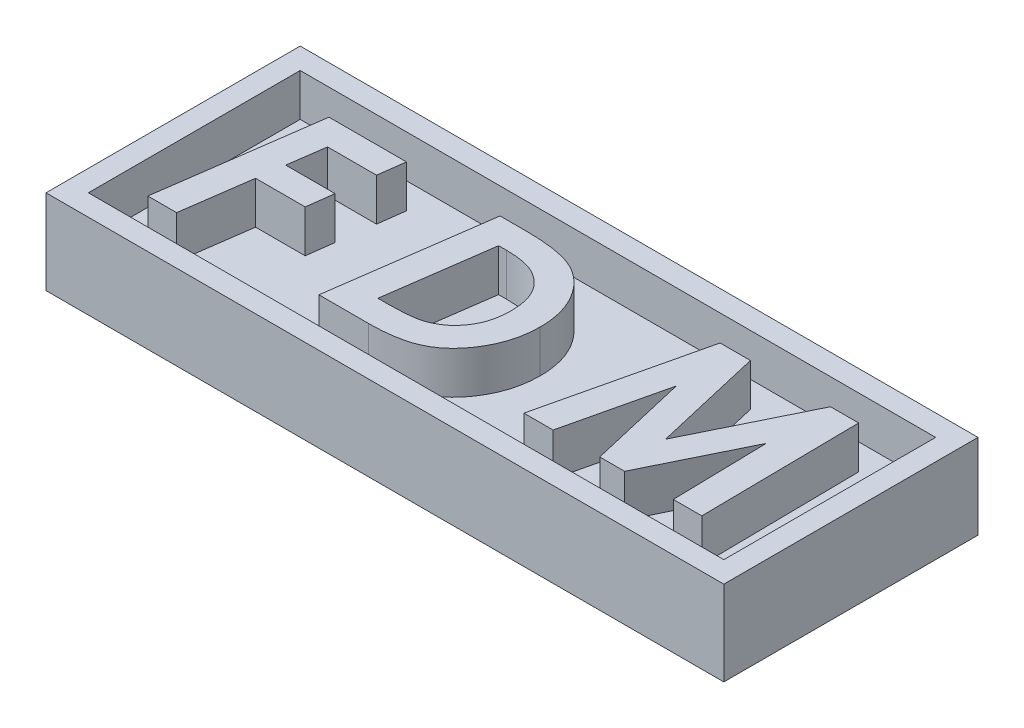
ISO-10303-21;
HEADER;
FILE_DESCRIPTION(('STEP AP214'),'2;1');
FILE_NAME('part.step','',(''),(''),'','','');
FILE_SCHEMA(('AUTOMOTIVE_DESIGN { 1 0 10303 214 1 1 1 1 }'));
ENDSEC;
DATA;
#1=APPLICATION_CONTEXT('core data for automotive mechanical design processes');
#2=APPLICATION_PROTOCOL_DEFINITION('international standard','automotive_design',2000,#1);
#3=PRODUCT_CONTEXT('',#1,'mechanical');
#4=PRODUCT('Part','Part','',(#3));
#5=PRODUCT_RELATED_PRODUCT_CATEGORY('part','',(#4));
#6=PRODUCT_DEFINITION_FORMATION('','',#4);
#7=PRODUCT_DEFINITION_CONTEXT('part definition',#1,'design');
#8=PRODUCT_DEFINITION('design','',#6,#7);
#9=PRODUCT_DEFINITION_SHAPE('','',#8);
#10=(LENGTH_UNIT() NAMED_UNIT(*) SI_UNIT(.MILLI.,.METRE.));
#11=(NAMED_UNIT(*) PLANE_ANGLE_UNIT() SI_UNIT($,.RADIAN.));
#12=(NAMED_UNIT(*) SI_UNIT($,.STERADIAN.) SOLID_ANGLE_UNIT());
#13=UNCERTAINTY_MEASURE_WITH_UNIT(LENGTH_MEASURE(1.E-05),#10,'distance_accuracy_value','');
#14=(GEOMETRIC_REPRESENTATION_CONTEXT(3) GLOBAL_UNCERTAINTY_ASSIGNED_CONTEXT((#13)) GLOBAL_UNIT_ASSIGNED_CONTEXT((#10,
#11,#12)) REPRESENTATION_CONTEXT('',''));
#15=CARTESIAN_POINT('',(0.,0.,0.));
#16=DIRECTION('',(0.,0.,1.));
#17=DIRECTION('',(1.,0.,0.));
#18=AXIS2_PLACEMENT_3D('',#15,#16,#17);
#19=CARTESIAN_POINT('',(0.,2.54,0.));
#20=DIRECTION('',(0.,-1.,0.));
#21=DIRECTION('',(0.,0.,-1.));
#22=AXIS2_PLACEMENT_3D('',#19,#20,#21);
#23=PLANE('',#22);
#24=DIRECTION('',(-1.,0.,0.));
#25=VECTOR('',#24,1.);
#26=CARTESIAN_POINT('',(7.1994020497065,2.54,4.735097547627));
#27=LINE('',#26,#25);
#28=CARTESIAN_POINT('',(7.1994020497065,2.54,4.735097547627));
#29=VERTEX_POINT('',#28);
#30=CARTESIAN_POINT('',(5.44780950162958,2.54,4.735097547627));
#31=VERTEX_POINT('',#30);
#32=EDGE_CURVE('E438',#29,#31,#27,.T.);
#33=ORIENTED_EDGE('',*,*,#32,.T.);
#34=DIRECTION('',(0.228745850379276,0.,-0.973486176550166));
#35=VECTOR('',#34,1.);
#36=CARTESIAN_POINT('',(5.44780950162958,2.54,4.735097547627));
#37=LINE('',#36,#35);
#38=CARTESIAN_POINT('',(7.68595553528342,2.54,-4.789902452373));
#39=VERTEX_POINT('',#38);
#40=EDGE_CURVE('E430',#31,#39,#37,.T.);
#41=ORIENTED_EDGE('',*,*,#40,.T.);
#42=DIRECTION('',(1.,0.,0.));
#43=VECTOR('',#42,1.);
#44=CARTESIAN_POINT('',(7.68595553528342,2.54,-4.789902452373));
#45=LINE('',#44,#43);
#46=CARTESIAN_POINT('',(9.50432993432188,2.54,-4.789902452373));
#47=VERTEX_POINT('',#46);
#48=EDGE_CURVE('E477',#39,#47,#45,.T.);
#49=ORIENTED_EDGE('',*,*,#48,.T.);
#50=DIRECTION('',(0.226556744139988,0.,0.973997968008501));
#51=VECTOR('',#50,1.);
#52=CARTESIAN_POINT('',(9.50432993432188,2.54,-4.789902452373));
#53=LINE('',#52,#51);
#54=CARTESIAN_POINT('',(11.0479447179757,2.54,1.8463054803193));
#55=VERTEX_POINT('',#54);
#56=EDGE_CURVE('E58',#47,#55,#53,.T.);
#57=ORIENTED_EDGE('',*,*,#56,.T.);
#58=DIRECTION('',(0.440801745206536,0.,-0.897604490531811));
#59=VECTOR('',#58,1.);
#60=CARTESIAN_POINT('',(11.0479447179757,2.54,1.8463054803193));
#61=LINE('',#60,#59);
#62=CARTESIAN_POINT('',(14.3068990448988,2.54,-4.789902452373));
#63=VERTEX_POINT('',#62);
#64=EDGE_CURVE('E481',#55,#63,#61,.T.);
#65=ORIENTED_EDGE('',*,*,#64,.T.);
#66=DIRECTION('',(1.,0.,0.));
#67=VECTOR('',#66,1.);
#68=CARTESIAN_POINT('',(14.3068990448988,2.54,-4.789902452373));
#69=LINE('',#68,#67);
#70=CARTESIAN_POINT('',(15.9936177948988,2.54,-4.789902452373));
#71=VERTEX_POINT('',#70);
#72=EDGE_CURVE('E484',#63,#71,#69,.T.);
#73=ORIENTED_EDGE('',*,*,#72,.T.);
#74=DIRECTION('',(0.0128194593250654,0.,0.999917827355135));
#75=VECTOR('',#74,1.);
#76=CARTESIAN_POINT('',(15.9936177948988,2.54,-4.789902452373));
#77=LINE('',#76,#75);
#78=CARTESIAN_POINT('',(16.1157331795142,2.54,4.735097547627));
#79=VERTEX_POINT('',#78);
#80=EDGE_CURVE('E487',#71,#79,#77,.T.);
#81=ORIENTED_EDGE('',*,*,#80,.T.);
#82=DIRECTION('',(-1.,0.,0.));
#83=VECTOR('',#82,1.);
#84=CARTESIAN_POINT('',(16.1157331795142,2.54,4.735097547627));
#85=LINE('',#84,#83);
#86=CARTESIAN_POINT('',(14.4061177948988,2.54,4.735097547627));
#87=VERTEX_POINT('',#86);
#88=EDGE_CURVE('E490',#79,#87,#85,.T.);
#89=ORIENTED_EDGE('',*,*,#88,.T.);
#90=DIRECTION('',(-0.0214284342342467,0.,-0.999770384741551));
#91=VECTOR('',#90,1.);
#92=CARTESIAN_POINT('',(14.4061177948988,2.54,4.735097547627));
#93=LINE('',#92,#91);
#94=CARTESIAN_POINT('',(14.2840024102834,2.54,-0.962348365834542));
#95=VERTEX_POINT('',#94);
#96=EDGE_CURVE('E493',#87,#95,#93,.T.);
#97=ORIENTED_EDGE('',*,*,#96,.T.);
#98=DIRECTION('',(-0.440708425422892,0.,0.897650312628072));
#99=VECTOR('',#98,1.);
#100=CARTESIAN_POINT('',(14.2840024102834,2.54,-0.962348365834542));
#101=LINE('',#100,#99);
#102=CARTESIAN_POINT('',(11.4867968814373,2.54,4.735097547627));
#103=VERTEX_POINT('',#102);
#104=EDGE_CURVE('E496',#95,#103,#101,.T.);
#105=ORIENTED_EDGE('',*,*,#104,.T.);
#106=DIRECTION('',(-1.,0.,0.));
#107=VECTOR('',#106,1.);
#108=CARTESIAN_POINT('',(11.4867968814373,2.54,4.735097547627));
#109=LINE('',#108,#107);
#110=CARTESIAN_POINT('',(9.99660757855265,2.54,4.735097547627));
#111=VERTEX_POINT('',#110);
#112=EDGE_CURVE('E499',#103,#111,#109,.T.);
#113=ORIENTED_EDGE('',*,*,#112,.T.);
#114=DIRECTION('',(-0.226424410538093,0.,-0.974028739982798));
#115=VECTOR('',#114,1.);
#116=CARTESIAN_POINT('',(9.99660757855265,2.54,4.735097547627));
#117=LINE('',#116,#115);
#118=CARTESIAN_POINT('',(8.60563702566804,2.54,-1.24855629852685));
#119=VERTEX_POINT('',#118);
#120=EDGE_CURVE('E502',#111,#119,#117,.T.);
#121=ORIENTED_EDGE('',*,*,#120,.T.);
#122=DIRECTION('',(-0.228779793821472,0.,0.973478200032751));
#123=VECTOR('',#122,1.);
#124=CARTESIAN_POINT('',(8.60563702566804,2.54,-1.24855629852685));
#125=LINE('',#124,#123);
#126=EDGE_CURVE('E505',#119,#29,#125,.T.);
#127=ORIENTED_EDGE('',*,*,#126,.T.);
#128=EDGE_LOOP('',(#33,#41,#49,#57,#65,#73,#81,#89,#97,#105,#113,#121,#127));
#129=FACE_BOUND('',#128,.T.);
#130=DIRECTION('',(-1.,0.,0.));
#131=VECTOR('',#130,1.);
#132=CARTESIAN_POINT('',(-3.88256910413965,2.54,4.735097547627));
#133=LINE('',#132,#131);
#134=CARTESIAN_POINT('',(-3.88256910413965,2.54,4.735097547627));
#135=VERTEX_POINT('',#134);
#136=CARTESIAN_POINT('',(-6.84195912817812,2.54,4.735097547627));
#137=VERTEX_POINT('',#136);
#138=EDGE_CURVE('E633',#135,#137,#133,.T.);
#139=ORIENTED_EDGE('',*,*,#138,.T.);
#140=DIRECTION('',(0.138865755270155,0.,-0.990311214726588));
#141=VECTOR('',#140,1.);
#142=CARTESIAN_POINT('',(-6.84195912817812,2.54,4.735097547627));
#143=LINE('',#142,#141);
#144=CARTESIAN_POINT('',(-5.50632210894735,2.54,-4.789902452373));
#145=VERTEX_POINT('',#144);
#146=EDGE_CURVE('E613',#137,#145,#143,.T.);
#147=ORIENTED_EDGE('',*,*,#146,.T.);
#148=DIRECTION('',(1.,0.,0.));
#149=VECTOR('',#148,1.);
#150=CARTESIAN_POINT('',(-5.50632210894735,2.54,-4.789902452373));
#151=LINE('',#150,#149);
#152=CARTESIAN_POINT('',(-4.00277643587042,2.54,-4.789902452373));
#153=VERTEX_POINT('',#152);
#154=EDGE_CURVE('E616',#145,#153,#151,.T.);
#155=ORIENTED_EDGE('',*,*,#154,.T.);
#156=CARTESIAN_POINT('',(-4.00277643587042,2.54,-4.789902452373));
#157=CARTESIAN_POINT('',(-3.83229986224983,2.54,-4.78849446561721));
#158=CARTESIAN_POINT('',(-3.50263127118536,2.54,-4.78577169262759));
#159=CARTESIAN_POINT('',(-3.02455397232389,2.54,-4.76332174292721));
#160=CARTESIAN_POINT('',(-2.58085669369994,2.54,-4.72369682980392));
#161=CARTESIAN_POINT('',(-2.17072756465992,2.54,-4.66885319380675));
#162=CARTESIAN_POINT('',(-1.79413324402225,2.54,-4.59888246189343));
#163=CARTESIAN_POINT('',(-1.45092989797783,2.54,-4.51415672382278));
#164=CARTESIAN_POINT('',(-1.14077546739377,2.54,-4.41392344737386));
#165=CARTESIAN_POINT('',(-0.862805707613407,2.54,-4.29349045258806));
#166=CARTESIAN_POINT('',(-0.606861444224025,2.54,-4.15834729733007));
#167=CARTESIAN_POINT('',(-0.367006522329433,2.54,-4.00414243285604));
#168=CARTESIAN_POINT('',(-0.139109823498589,2.54,-3.83280171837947));
#169=CARTESIAN_POINT('',(0.0783654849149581,2.54,-3.64540929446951));
#170=CARTESIAN_POINT('',(0.281011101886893,2.54,-3.43784900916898));
#171=CARTESIAN_POINT('',(0.471678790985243,2.54,-3.21230865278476));
#172=CARTESIAN_POINT('',(0.651098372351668,2.54,-2.96927715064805));
#173=CARTESIAN_POINT('',(0.81866455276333,2.54,-2.71127751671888));
#174=CARTESIAN_POINT('',(0.969391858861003,2.54,-2.43849121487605));
#175=CARTESIAN_POINT('',(1.10106378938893,2.54,-2.15337539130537));
#176=CARTESIAN_POINT('',(1.21411225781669,2.54,-1.85863400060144));
#177=CARTESIAN_POINT('',(1.30352721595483,2.54,-1.5526490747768));
#178=CARTESIAN_POINT('',(1.37421241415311,2.54,-1.23715558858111));
#179=CARTESIAN_POINT('',(1.42559632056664,2.54,-0.910923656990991));
#180=CARTESIAN_POINT('',(1.45696282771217,2.54,-0.574362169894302));
#181=CARTESIAN_POINT('',(1.46023239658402,2.54,-0.346751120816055));
#182=CARTESIAN_POINT('',(1.46188702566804,2.54,-0.231564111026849));
#183=B_SPLINE_CURVE_WITH_KNOTS('',3,(#156,#157,#158,#159,#160,#161,#162,#163,#164,#165,#166,
#167,#168,#169,#170,#171,#172,#173,#174,#175,#176,#177,#178,#179,#180,#181,#182),.UNSPECIFIED.,
.F.,.F.,(4,1,1,1,1,1,1,1,1,1,1,1,1,1,1,1,1,1,1,1,1,1,1,1,4),(0.,0.0628720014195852,
0.121582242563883,0.176458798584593,0.227115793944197,0.274134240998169,0.317656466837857,
0.357416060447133,0.394192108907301,0.429239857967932,0.464052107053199,0.49923774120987,
0.534323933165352,0.569820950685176,0.606102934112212,0.643165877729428,0.68116346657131,
0.719485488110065,0.758002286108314,0.796905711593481,0.83579782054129,0.875463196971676,
0.916071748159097,0.957526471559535,1.),.UNSPECIFIED.);
#184=CARTESIAN_POINT('',(1.46188702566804,2.54,-0.231564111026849));
#185=VERTEX_POINT('',#184);
#186=EDGE_CURVE('E620',#153,#185,#183,.T.);
#187=ORIENTED_EDGE('',*,*,#186,.T.);
#188=CARTESIAN_POINT('',(1.46188702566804,2.54,-0.231564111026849));
#189=CARTESIAN_POINT('',(1.45956216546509,2.54,-0.112557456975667));
#190=CARTESIAN_POINT('',(1.45494118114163,2.54,0.123984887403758));
#191=CARTESIAN_POINT('',(1.42178361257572,2.54,0.474510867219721));
#192=CARTESIAN_POINT('',(1.36816117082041,2.54,0.817938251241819));
#193=CARTESIAN_POINT('',(1.29424829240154,2.54,1.15414768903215));
#194=CARTESIAN_POINT('',(1.1969025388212,2.54,1.48327328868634));
#195=CARTESIAN_POINT('',(1.0753557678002,2.54,1.80358094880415));
#196=CARTESIAN_POINT('',(0.936958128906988,2.54,2.11827443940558));
#197=CARTESIAN_POINT('',(0.774323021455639,2.54,2.42088183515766));
#198=CARTESIAN_POINT('',(0.598931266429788,2.54,2.7114315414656));
#199=CARTESIAN_POINT('',(0.409038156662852,2.54,2.98310692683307));
#200=CARTESIAN_POINT('',(0.209871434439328,2.54,3.23561477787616));
#201=CARTESIAN_POINT('',(-0.00357694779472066,2.54,3.46549096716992));
#202=CARTESIAN_POINT('',(-0.227206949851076,2.54,3.67601132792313));
#203=CARTESIAN_POINT('',(-0.461101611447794,2.54,3.86717100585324));
#204=CARTESIAN_POINT('',(-0.707784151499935,2.54,4.03631834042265));
#205=CARTESIAN_POINT('',(-0.966977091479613,2.54,4.18645837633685));
#206=CARTESIAN_POINT('',(-1.24558104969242,2.54,4.31806835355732));
#207=CARTESIAN_POINT('',(-1.54786115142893,2.54,4.42956093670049));
#208=CARTESIAN_POINT('',(-1.87474640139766,2.54,4.52538636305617));
#209=CARTESIAN_POINT('',(-2.227801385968,2.54,4.60019469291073));
#210=CARTESIAN_POINT('',(-2.60534191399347,2.54,4.66126477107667));
#211=CARTESIAN_POINT('',(-3.00844466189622,2.54,4.7050058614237));
#212=CARTESIAN_POINT('',(-3.43706375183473,2.54,4.72895141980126));
#213=CARTESIAN_POINT('',(-3.73116810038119,2.54,4.73300884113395));
#214=CARTESIAN_POINT('',(-3.88256910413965,2.54,4.735097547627));
#215=B_SPLINE_CURVE_WITH_KNOTS('',3,(#188,#189,#190,#191,#192,#193,#194,#195,#196,#197,#198,
#199,#200,#201,#202,#203,#204,#205,#206,#207,#208,#209,#210,#211,#212,#213,#214),.UNSPECIFIED.,
.F.,.F.,(4,1,1,1,1,1,1,1,1,1,1,1,1,1,1,1,1,1,1,1,1,1,1,1,4),(0.,0.0431386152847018,
0.0857440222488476,0.127517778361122,0.169082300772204,0.210446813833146,0.251816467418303,
0.293206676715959,0.334980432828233,0.376263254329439,0.416175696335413,0.455065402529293,
0.492755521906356,0.529782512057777,0.566332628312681,0.602147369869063,0.638096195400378,
0.674813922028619,0.71370089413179,0.754779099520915,0.798194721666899,0.844439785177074,
0.893378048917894,0.945112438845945,1.),.UNSPECIFIED.);
#216=EDGE_CURVE('E625',#185,#135,#215,.T.);
#217=ORIENTED_EDGE('',*,*,#216,.T.);
#218=EDGE_LOOP('',(#139,#147,#155,#187,#217));
#219=FACE_BOUND('',#218,.T.);
#220=DIRECTION('',(0.,0.,-1.));
#221=VECTOR('',#220,1.);
#222=CARTESIAN_POINT('',(19.05,2.54,6.35));
#223=LINE('',#222,#221);
#224=CARTESIAN_POINT('',(19.05,2.54,6.35));
#225=VERTEX_POINT('',#224);
#226=CARTESIAN_POINT('',(19.05,2.54,-4.77138182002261));
#227=VERTEX_POINT('',#226);
#228=EDGE_CURVE('E345',#225,#227,#223,.T.);
#229=ORIENTED_EDGE('',*,*,#228,.T.);
#230=DIRECTION('',(1.,0.,0.));
#231=VECTOR('',#230,1.);
#232=CARTESIAN_POINT('',(19.05,2.54,-4.77138182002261));
#233=LINE('',#232,#231);
#234=CARTESIAN_POINT('',(16.8721866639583,2.54,-4.77138182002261));
#235=VERTEX_POINT('',#234);
#236=EDGE_CURVE('E330',#235,#227,#233,.T.);
#237=ORIENTED_EDGE('',*,*,#236,.F.);
#238=DIRECTION('',(0.,0.,1.));
#239=VECTOR('',#238,1.);
#240=CARTESIAN_POINT('',(16.8721866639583,2.54,-6.35));
#241=LINE('',#240,#239);
#242=CARTESIAN_POINT('',(16.8721866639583,2.54,-6.35));
#243=VERTEX_POINT('',#242);
#244=EDGE_CURVE('E324',#243,#235,#241,.T.);
#245=ORIENTED_EDGE('',*,*,#244,.F.);
#246=DIRECTION('',(-1.,0.,0.));
#247=VECTOR('',#246,1.);
#248=CARTESIAN_POINT('',(-19.05,2.54,-6.35));
#249=LINE('',#248,#247);
#250=CARTESIAN_POINT('',(-19.05,2.54,-6.35));
#251=VERTEX_POINT('',#250);
#252=EDGE_CURVE('E336',#243,#251,#249,.T.);
#253=ORIENTED_EDGE('',*,*,#252,.T.);
#254=DIRECTION('',(0.,0.,1.));
#255=VECTOR('',#254,1.);
#256=CARTESIAN_POINT('',(-19.05,2.54,6.35));
#257=LINE('',#256,#255);
#258=CARTESIAN_POINT('',(-19.05,2.54,6.35));
#259=VERTEX_POINT('',#258);
#260=EDGE_CURVE('E344',#251,#259,#257,.T.);
#261=ORIENTED_EDGE('',*,*,#260,.T.);
#262=DIRECTION('',(1.,0.,0.));
#263=VECTOR('',#262,1.);
#264=CARTESIAN_POINT('',(-19.05,2.54,6.35));
#265=LINE('',#264,#263);
#266=EDGE_CURVE('E347',#259,#225,#265,.T.);
#267=ORIENTED_EDGE('',*,*,#266,.T.);
#268=EDGE_LOOP('',(#229,#237,#245,#253,#261,#267));
#269=FACE_BOUND('',#268,.T.);
#270=DIRECTION('',(-1.,0.,0.));
#271=VECTOR('',#270,1.);
#272=CARTESIAN_POINT('',(-15.3747716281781,2.54,4.735097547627));
#273=LINE('',#272,#271);
#274=CARTESIAN_POINT('',(-15.3747716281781,2.54,4.735097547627));
#275=VERTEX_POINT('',#274);
#276=CARTESIAN_POINT('',(-17.0996514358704,2.54,4.735097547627));
#277=VERTEX_POINT('',#276);
#278=EDGE_CURVE('E655',#275,#277,#273,.T.);
#279=ORIENTED_EDGE('',*,*,#278,.T.);
#280=DIRECTION('',(0.138865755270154,0.,-0.990311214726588));
#281=VECTOR('',#280,1.);
#282=CARTESIAN_POINT('',(-17.0996514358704,2.54,4.735097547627));
#283=LINE('',#282,#281);
#284=CARTESIAN_POINT('',(-15.7640144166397,2.54,-4.789902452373));
#285=VERTEX_POINT('',#284);
#286=EDGE_CURVE('E642',#277,#285,#283,.T.);
#287=ORIENTED_EDGE('',*,*,#286,.T.);
#288=DIRECTION('',(1.,0.,0.));
#289=VECTOR('',#288,1.);
#290=CARTESIAN_POINT('',(-15.7640144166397,2.54,-4.789902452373));
#291=LINE('',#290,#289);
#292=CARTESIAN_POINT('',(-11.1159975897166,2.54,-4.789902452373));
#293=VERTEX_POINT('',#292);
#294=EDGE_CURVE('E685',#285,#293,#291,.T.);
#295=ORIENTED_EDGE('',*,*,#294,.T.);
#296=DIRECTION('',(-0.1298995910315,0.,0.99152715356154));
#297=VECTOR('',#296,1.);
#298=CARTESIAN_POINT('',(-11.1159975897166,2.54,-4.789902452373));
#299=LINE('',#298,#297);
#300=CARTESIAN_POINT('',(-11.3239753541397,2.54,-3.202402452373));
#301=VERTEX_POINT('',#300);
#302=EDGE_CURVE('E688',#293,#301,#299,.T.);
#303=ORIENTED_EDGE('',*,*,#302,.T.);
#304=DIRECTION('',(-1.,0.,0.));
#305=VECTOR('',#304,1.);
#306=CARTESIAN_POINT('',(-11.3239753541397,2.54,-3.202402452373));
#307=LINE('',#306,#305);
#308=CARTESIAN_POINT('',(-14.2604687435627,2.54,-3.202402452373));
#309=VERTEX_POINT('',#308);
#310=EDGE_CURVE('E691',#301,#309,#307,.T.);
#311=ORIENTED_EDGE('',*,*,#310,.T.);
#312=DIRECTION('',(-0.139254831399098,0.,0.990256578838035));
#313=VECTOR('',#312,1.);
#314=CARTESIAN_POINT('',(-14.2604687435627,2.54,-3.202402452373));
#315=LINE('',#314,#313);
#316=CARTESIAN_POINT('',(-14.5695733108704,2.54,-1.00432552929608));
#317=VERTEX_POINT('',#316);
#318=EDGE_CURVE('E694',#309,#317,#315,.T.);
#319=ORIENTED_EDGE('',*,*,#318,.T.);
#320=DIRECTION('',(1.,0.,0.));
#321=VECTOR('',#320,1.);
#322=CARTESIAN_POINT('',(-14.5695733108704,2.54,-1.00432552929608));
#323=LINE('',#322,#321);
#324=CARTESIAN_POINT('',(-11.610183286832,2.54,-1.00432552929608));
#325=VERTEX_POINT('',#324);
#326=EDGE_CURVE('E697',#317,#325,#323,.T.);
#327=ORIENTED_EDGE('',*,*,#326,.T.);
#328=DIRECTION('',(-0.1298995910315,0.,0.99152715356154));
#329=VECTOR('',#328,1.);
#330=CARTESIAN_POINT('',(-11.610183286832,2.54,-1.00432552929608));
#331=LINE('',#330,#329);
#332=CARTESIAN_POINT('',(-11.818161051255,2.54,0.58317447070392));
#333=VERTEX_POINT('',#332);
#334=EDGE_CURVE('E700',#325,#333,#331,.T.);
#335=ORIENTED_EDGE('',*,*,#334,.T.);
#336=DIRECTION('',(-1.,0.,0.));
#337=VECTOR('',#336,1.);
#338=CARTESIAN_POINT('',(-11.818161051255,2.54,0.58317447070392));
#339=LINE('',#338,#337);
#340=CARTESIAN_POINT('',(-14.7909074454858,2.54,0.58317447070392));
#341=VERTEX_POINT('',#340);
#342=EDGE_CURVE('E703',#333,#341,#339,.T.);
#343=ORIENTED_EDGE('',*,*,#342,.T.);
#344=DIRECTION('',(-0.139254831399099,0.,0.990256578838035));
#345=VECTOR('',#344,1.);
#346=CARTESIAN_POINT('',(-14.7909074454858,2.54,0.58317447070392));
#347=LINE('',#346,#345);
#348=EDGE_CURVE('E706',#341,#275,#347,.T.);
#349=ORIENTED_EDGE('',*,*,#348,.T.);
#350=EDGE_LOOP('',(#279,#287,#295,#303,#311,#319,#327,#335,#343,#349));
#351=FACE_BOUND('',#350,.T.);
#352=ADVANCED_FACE('F35',(#129,#219,#269,#351),#23,.F.);
#353=CARTESIAN_POINT('',(20.32,5.08,7.62));
#354=DIRECTION('',(-1.,0.,0.));
#355=DIRECTION('',(0.,0.,1.));
#356=AXIS2_PLACEMENT_3D('',#353,#354,#355);
#357=PLANE('',#356);
#358=DIRECTION('',(0.,0.,-1.));
#359=VECTOR('',#358,1.);
#360=CARTESIAN_POINT('',(20.32,0.,7.62));
#361=LINE('',#360,#359);
#362=CARTESIAN_POINT('',(20.32,0.,7.62));
#363=VERTEX_POINT('',#362);
#364=CARTESIAN_POINT('',(20.32,0.,-7.62));
#365=VERTEX_POINT('',#364);
#366=EDGE_CURVE('E368',#363,#365,#361,.T.);
#367=ORIENTED_EDGE('',*,*,#366,.T.);
#368=DIRECTION('',(0.,-1.,0.));
#369=VECTOR('',#368,1.);
#370=CARTESIAN_POINT('',(20.32,5.08,-7.62));
#371=LINE('',#370,#369);
#372=CARTESIAN_POINT('',(20.32,5.08,-7.62));
#373=VERTEX_POINT('',#372);
#374=EDGE_CURVE('E400',#373,#365,#371,.T.);
#375=ORIENTED_EDGE('',*,*,#374,.F.);
#376=DIRECTION('',(0.,0.,-1.));
#377=VECTOR('',#376,1.);
#378=CARTESIAN_POINT('',(20.32,5.08,7.62));
#379=LINE('',#378,#377);
#380=CARTESIAN_POINT('',(20.32,5.08,7.62));
#381=VERTEX_POINT('',#380);
#382=EDGE_CURVE('E374',#381,#373,#379,.T.);
#383=ORIENTED_EDGE('',*,*,#382,.F.);
#384=DIRECTION('',(0.,-1.,0.));
#385=VECTOR('',#384,1.);
#386=CARTESIAN_POINT('',(20.32,5.08,7.62));
#387=LINE('',#386,#385);
#388=EDGE_CURVE('E384',#381,#363,#387,.T.);
#389=ORIENTED_EDGE('',*,*,#388,.T.);
#390=EDGE_LOOP('',(#367,#375,#383,#389));
#391=FACE_BOUND('',#390,.T.);
#392=ADVANCED_FACE('F37',(#391),#357,.F.);
#393=CARTESIAN_POINT('',(-20.32,5.08,-7.62));
#394=DIRECTION('',(0.,0.,1.));
#395=DIRECTION('',(1.,0.,0.));
#396=AXIS2_PLACEMENT_3D('',#393,#394,#395);
#397=PLANE('',#396);
#398=DIRECTION('',(-1.,0.,0.));
#399=VECTOR('',#398,1.);
#400=CARTESIAN_POINT('',(-20.32,0.,-7.62));
#401=LINE('',#400,#399);
#402=CARTESIAN_POINT('',(-20.32,0.,-7.62));
#403=VERTEX_POINT('',#402);
#404=EDGE_CURVE('E387',#365,#403,#401,.T.);
#405=ORIENTED_EDGE('',*,*,#404,.T.);
#406=DIRECTION('',(0.,-1.,0.));
#407=VECTOR('',#406,1.);
#408=CARTESIAN_POINT('',(-20.32,5.08,-7.62));
#409=LINE('',#408,#407);
#410=CARTESIAN_POINT('',(-20.32,5.08,-7.62));
#411=VERTEX_POINT('',#410);
#412=EDGE_CURVE('E397',#411,#403,#409,.T.);
#413=ORIENTED_EDGE('',*,*,#412,.F.);
#414=DIRECTION('',(-1.,0.,0.));
#415=VECTOR('',#414,1.);
#416=CARTESIAN_POINT('',(-20.32,5.08,-7.62));
#417=LINE('',#416,#415);
#418=EDGE_CURVE('E377',#373,#411,#417,.T.);
#419=ORIENTED_EDGE('',*,*,#418,.F.);
#420=ORIENTED_EDGE('',*,*,#374,.T.);
#421=EDGE_LOOP('',(#405,#413,#419,#420));
#422=FACE_BOUND('',#421,.T.);
#423=ADVANCED_FACE('F783',(#422),#397,.F.);
#424=CARTESIAN_POINT('',(-20.32,5.08,7.62));
#425=DIRECTION('',(1.,0.,0.));
#426=DIRECTION('',(0.,0.,-1.));
#427=AXIS2_PLACEMENT_3D('',#424,#425,#426);
#428=PLANE('',#427);
#429=DIRECTION('',(0.,0.,1.));
#430=VECTOR('',#429,1.);
#431=CARTESIAN_POINT('',(-20.32,0.,7.62));
#432=LINE('',#431,#430);
#433=CARTESIAN_POINT('',(-20.32,0.,7.62));
#434=VERTEX_POINT('',#433);
#435=EDGE_CURVE('E389',#403,#434,#432,.T.);
#436=ORIENTED_EDGE('',*,*,#435,.T.);
#437=DIRECTION('',(0.,-1.,0.));
#438=VECTOR('',#437,1.);
#439=CARTESIAN_POINT('',(-20.32,5.08,7.62));
#440=LINE('',#439,#438);
#441=CARTESIAN_POINT('',(-20.32,5.08,7.62));
#442=VERTEX_POINT('',#441);
#443=EDGE_CURVE('E394',#442,#434,#440,.T.);
#444=ORIENTED_EDGE('',*,*,#443,.F.);
#445=DIRECTION('',(0.,0.,1.));
#446=VECTOR('',#445,1.);
#447=CARTESIAN_POINT('',(-20.32,5.08,7.62));
#448=LINE('',#447,#446);
#449=EDGE_CURVE('E380',#411,#442,#448,.T.);
#450=ORIENTED_EDGE('',*,*,#449,.F.);
#451=ORIENTED_EDGE('',*,*,#412,.T.);
#452=EDGE_LOOP('',(#436,#444,#450,#451));
#453=FACE_BOUND('',#452,.T.);
#454=ADVANCED_FACE('F885',(#453),#428,.F.);
#455=CARTESIAN_POINT('',(-20.32,5.08,7.62));
#456=DIRECTION('',(0.,0.,-1.));
#457=DIRECTION('',(-1.,0.,0.));
#458=AXIS2_PLACEMENT_3D('',#455,#456,#457);
#459=PLANE('',#458);
#460=DIRECTION('',(1.,0.,0.));
#461=VECTOR('',#460,1.);
#462=CARTESIAN_POINT('',(-20.32,0.,7.62));
#463=LINE('',#462,#461);
#464=EDGE_CURVE('E378',#434,#363,#463,.T.);
#465=ORIENTED_EDGE('',*,*,#464,.T.);
#466=ORIENTED_EDGE('',*,*,#388,.F.);
#467=DIRECTION('',(1.,0.,0.));
#468=VECTOR('',#467,1.);
#469=CARTESIAN_POINT('',(-20.32,5.08,7.62));
#470=LINE('',#469,#468);
#471=EDGE_CURVE('E382',#442,#381,#470,.T.);
#472=ORIENTED_EDGE('',*,*,#471,.F.);
#473=ORIENTED_EDGE('',*,*,#443,.T.);
#474=EDGE_LOOP('',(#465,#466,#472,#473));
#475=FACE_BOUND('',#474,.T.);
#476=ADVANCED_FACE('F880',(#475),#459,.F.);
#477=CARTESIAN_POINT('',(0.,5.08,0.));
#478=DIRECTION('',(0.,-1.,0.));
#479=DIRECTION('',(0.,0.,-1.));
#480=AXIS2_PLACEMENT_3D('',#477,#478,#479);
#481=PLANE('',#480);
#482=DIRECTION('',(-1.,0.,0.));
#483=VECTOR('',#482,1.);
#484=CARTESIAN_POINT('',(-19.05,5.08,-6.35));
#485=LINE('',#484,#483);
#486=CARTESIAN_POINT('',(19.05,5.08,-6.35));
#487=VERTEX_POINT('',#486);
#488=CARTESIAN_POINT('',(-19.05,5.08,-6.35));
#489=VERTEX_POINT('',#488);
#490=EDGE_CURVE('E358',#487,#489,#485,.T.);
#491=ORIENTED_EDGE('',*,*,#490,.F.);
#492=DIRECTION('',(0.,0.,-1.));
#493=VECTOR('',#492,1.);
#494=CARTESIAN_POINT('',(19.05,5.08,6.35));
#495=LINE('',#494,#493);
#496=CARTESIAN_POINT('',(19.05,5.08,6.35));
#497=VERTEX_POINT('',#496);
#498=EDGE_CURVE('E356',#497,#487,#495,.T.);
#499=ORIENTED_EDGE('',*,*,#498,.F.);
#500=DIRECTION('',(1.,0.,0.));
#501=VECTOR('',#500,1.);
#502=CARTESIAN_POINT('',(-19.05,5.08,6.35));
#503=LINE('',#502,#501);
#504=CARTESIAN_POINT('',(-19.05,5.08,6.35));
#505=VERTEX_POINT('',#504);
#506=EDGE_CURVE('E349',#505,#497,#503,.T.);
#507=ORIENTED_EDGE('',*,*,#506,.F.);
#508=DIRECTION('',(0.,0.,1.));
#509=VECTOR('',#508,1.);
#510=CARTESIAN_POINT('',(-19.05,5.08,6.35));
#511=LINE('',#510,#509);
#512=EDGE_CURVE('E361',#489,#505,#511,.T.);
#513=ORIENTED_EDGE('',*,*,#512,.F.);
#514=EDGE_LOOP('',(#491,#499,#507,#513));
#515=FACE_BOUND('',#514,.T.);
#516=ORIENTED_EDGE('',*,*,#382,.T.);
#517=ORIENTED_EDGE('',*,*,#418,.T.);
#518=ORIENTED_EDGE('',*,*,#449,.T.);
#519=ORIENTED_EDGE('',*,*,#471,.T.);
#520=EDGE_LOOP('',(#516,#517,#518,#519));
#521=FACE_BOUND('',#520,.T.);
#522=ADVANCED_FACE('F420',(#515,#521),#481,.F.);
#523=CARTESIAN_POINT('',(0.,0.,0.));
#524=DIRECTION('',(0.,-1.,0.));
#525=DIRECTION('',(0.,0.,-1.));
#526=AXIS2_PLACEMENT_3D('',#523,#524,#525);
#527=PLANE('',#526);
#528=DIRECTION('',(0.,0.,1.));
#529=VECTOR('',#528,1.);
#530=CARTESIAN_POINT('',(19.05,0.,0.));
#531=LINE('',#530,#529);
#532=CARTESIAN_POINT('',(19.05,0.,-6.35));
#533=VERTEX_POINT('',#532);
#534=CARTESIAN_POINT('',(19.05,0.,-4.77138182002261));
#535=VERTEX_POINT('',#534);
#536=EDGE_CURVE('E11',#533,#535,#531,.T.);
#537=ORIENTED_EDGE('',*,*,#536,.F.);
#538=DIRECTION('',(1.,0.,0.));
#539=VECTOR('',#538,1.);
#540=CARTESIAN_POINT('',(0.,0.,-6.35));
#541=LINE('',#540,#539);
#542=CARTESIAN_POINT('',(16.8721866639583,0.,-6.35));
#543=VERTEX_POINT('',#542);
#544=EDGE_CURVE('E403',#543,#533,#541,.T.);
#545=ORIENTED_EDGE('',*,*,#544,.F.);
#546=DIRECTION('',(0.,0.,-1.));
#547=VECTOR('',#546,1.);
#548=CARTESIAN_POINT('',(16.8721866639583,0.,0.));
#549=LINE('',#548,#547);
#550=CARTESIAN_POINT('',(16.8721866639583,0.,-4.77138182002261));
#551=VERTEX_POINT('',#550);
#552=EDGE_CURVE('E327',#551,#543,#549,.T.);
#553=ORIENTED_EDGE('',*,*,#552,.F.);
#554=DIRECTION('',(-1.,0.,0.));
#555=VECTOR('',#554,1.);
#556=CARTESIAN_POINT('',(0.,0.,-4.77138182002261));
#557=LINE('',#556,#555);
#558=EDGE_CURVE('E43',#535,#551,#557,.T.);
#559=ORIENTED_EDGE('',*,*,#558,.F.);
#560=EDGE_LOOP('',(#537,#545,#553,#559));
#561=FACE_BOUND('',#560,.T.);
#562=ORIENTED_EDGE('',*,*,#366,.F.);
#563=ORIENTED_EDGE('',*,*,#464,.F.);
#564=ORIENTED_EDGE('',*,*,#435,.F.);
#565=ORIENTED_EDGE('',*,*,#404,.F.);
#566=EDGE_LOOP('',(#562,#563,#564,#565));
#567=FACE_BOUND('',#566,.T.);
#568=ADVANCED_FACE('F413',(#561,#567),#527,.T.);
#569=CARTESIAN_POINT('',(19.05,2.54,6.35));
#570=DIRECTION('',(1.,0.,0.));
#571=DIRECTION('',(0.,0.,-1.));
#572=AXIS2_PLACEMENT_3D('',#569,#570,#571);
#573=PLANE('',#572);
#574=ORIENTED_EDGE('',*,*,#498,.T.);
#575=DIRECTION('',(0.,1.,0.));
#576=VECTOR('',#575,1.);
#577=CARTESIAN_POINT('',(19.05,2.54,-6.35));
#578=LINE('',#577,#576);
#579=EDGE_CURVE('E355',#533,#487,#578,.T.);
#580=ORIENTED_EDGE('',*,*,#579,.F.);
#581=ORIENTED_EDGE('',*,*,#536,.T.);
#582=DIRECTION('',(0.,1.,0.));
#583=VECTOR('',#582,1.);
#584=CARTESIAN_POINT('',(19.05,-2.54,-4.77138182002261));
#585=LINE('',#584,#583);
#586=EDGE_CURVE('E409',#535,#227,#585,.T.);
#587=ORIENTED_EDGE('',*,*,#586,.T.);
#588=ORIENTED_EDGE('',*,*,#228,.F.);
#589=DIRECTION('',(0.,1.,0.));
#590=VECTOR('',#589,1.);
#591=CARTESIAN_POINT('',(19.05,2.54,6.35));
#592=LINE('',#591,#590);
#593=EDGE_CURVE('E366',#225,#497,#592,.T.);
#594=ORIENTED_EDGE('',*,*,#593,.T.);
#595=EDGE_LOOP('',(#574,#580,#581,#587,#588,#594));
#596=FACE_BOUND('',#595,.T.);
#597=ADVANCED_FACE('F429',(#596),#573,.F.);
#598=CARTESIAN_POINT('',(-19.05,2.54,6.35));
#599=DIRECTION('',(0.,0.,1.));
#600=DIRECTION('',(1.,0.,0.));
#601=AXIS2_PLACEMENT_3D('',#598,#599,#600);
#602=PLANE('',#601);
#603=ORIENTED_EDGE('',*,*,#506,.T.);
#604=ORIENTED_EDGE('',*,*,#593,.F.);
#605=ORIENTED_EDGE('',*,*,#266,.F.);
#606=DIRECTION('',(0.,1.,0.));
#607=VECTOR('',#606,1.);
#608=CARTESIAN_POINT('',(-19.05,2.54,6.35));
#609=LINE('',#608,#607);
#610=EDGE_CURVE('E369',#259,#505,#609,.T.);
#611=ORIENTED_EDGE('',*,*,#610,.T.);
#612=EDGE_LOOP('',(#603,#604,#605,#611));
#613=FACE_BOUND('',#612,.T.);
#614=ADVANCED_FACE('F427',(#613),#602,.F.);
#615=CARTESIAN_POINT('',(-19.05,2.54,6.35));
#616=DIRECTION('',(-1.,0.,0.));
#617=DIRECTION('',(0.,0.,1.));
#618=AXIS2_PLACEMENT_3D('',#615,#616,#617);
#619=PLANE('',#618);
#620=ORIENTED_EDGE('',*,*,#512,.T.);
#621=ORIENTED_EDGE('',*,*,#610,.F.);
#622=ORIENTED_EDGE('',*,*,#260,.F.);
#623=DIRECTION('',(0.,1.,0.));
#624=VECTOR('',#623,1.);
#625=CARTESIAN_POINT('',(-19.05,2.54,-6.35));
#626=LINE('',#625,#624);
#627=EDGE_CURVE('E342',#251,#489,#626,.T.);
#628=ORIENTED_EDGE('',*,*,#627,.T.);
#629=EDGE_LOOP('',(#620,#621,#622,#628));
#630=FACE_BOUND('',#629,.T.);
#631=ADVANCED_FACE('F424',(#630),#619,.F.);
#632=CARTESIAN_POINT('',(-19.05,2.54,-6.35));
#633=DIRECTION('',(0.,0.,-1.));
#634=DIRECTION('',(-1.,0.,0.));
#635=AXIS2_PLACEMENT_3D('',#632,#633,#634);
#636=PLANE('',#635);
#637=ORIENTED_EDGE('',*,*,#490,.T.);
#638=ORIENTED_EDGE('',*,*,#627,.F.);
#639=ORIENTED_EDGE('',*,*,#252,.F.);
#640=DIRECTION('',(0.,1.,0.));
#641=VECTOR('',#640,1.);
#642=CARTESIAN_POINT('',(16.8721866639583,-2.54,-6.35));
#643=LINE('',#642,#641);
#644=EDGE_CURVE('E50',#543,#243,#643,.T.);
#645=ORIENTED_EDGE('',*,*,#644,.F.);
#646=ORIENTED_EDGE('',*,*,#544,.T.);
#647=ORIENTED_EDGE('',*,*,#579,.T.);
#648=EDGE_LOOP('',(#637,#638,#639,#645,#646,#647));
#649=FACE_BOUND('',#648,.T.);
#650=ADVANCED_FACE('F341',(#649),#636,.F.);
#651=CARTESIAN_POINT('',(-17.0996514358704,5.08,4.735097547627));
#652=DIRECTION('',(-0.990311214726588,0.,-0.138865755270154));
#653=DIRECTION('',(-0.138865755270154,0.,0.990311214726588));
#654=AXIS2_PLACEMENT_3D('',#651,#652,#653);
#655=PLANE('',#654);
#656=ORIENTED_EDGE('',*,*,#286,.F.);
#657=DIRECTION('',(0.,-1.,0.));
#658=VECTOR('',#657,1.);
#659=CARTESIAN_POINT('',(-17.0996514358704,5.08,4.735097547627));
#660=LINE('',#659,#658);
#661=CARTESIAN_POINT('',(-17.0996514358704,5.08,4.735097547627));
#662=VERTEX_POINT('',#661);
#663=EDGE_CURVE('E359',#662,#277,#660,.T.);
#664=ORIENTED_EDGE('',*,*,#663,.F.);
#665=DIRECTION('',(0.138865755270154,0.,-0.990311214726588));
#666=VECTOR('',#665,1.);
#667=CARTESIAN_POINT('',(-17.0996514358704,5.08,4.735097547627));
#668=LINE('',#667,#666);
#669=CARTESIAN_POINT('',(-15.7640144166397,5.08,-4.789902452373));
#670=VERTEX_POINT('',#669);
#671=EDGE_CURVE('E651',#662,#670,#668,.T.);
#672=ORIENTED_EDGE('',*,*,#671,.T.);
#673=DIRECTION('',(0.,-1.,0.));
#674=VECTOR('',#673,1.);
#675=CARTESIAN_POINT('',(-15.7640144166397,5.08,-4.789902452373));
#676=LINE('',#675,#674);
#677=EDGE_CURVE('E682',#670,#285,#676,.T.);
#678=ORIENTED_EDGE('',*,*,#677,.T.);
#679=EDGE_LOOP('',(#656,#664,#672,#678));
#680=FACE_BOUND('',#679,.T.);
#681=ADVANCED_FACE('F731',(#680),#655,.T.);
#682=CARTESIAN_POINT('',(-15.3747716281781,5.08,4.735097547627));
#683=DIRECTION('',(0.,0.,1.));
#684=DIRECTION('',(1.,0.,0.));
#685=AXIS2_PLACEMENT_3D('',#682,#683,#684);
#686=PLANE('',#685);
#687=ORIENTED_EDGE('',*,*,#278,.F.);
#688=DIRECTION('',(0.,-1.,0.));
#689=VECTOR('',#688,1.);
#690=CARTESIAN_POINT('',(-15.3747716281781,5.08,4.735097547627));
#691=LINE('',#690,#689);
#692=CARTESIAN_POINT('',(-15.3747716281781,5.08,4.735097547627));
#693=VERTEX_POINT('',#692);
#694=EDGE_CURVE('E712',#693,#275,#691,.T.);
#695=ORIENTED_EDGE('',*,*,#694,.F.);
#696=DIRECTION('',(-1.,0.,0.));
#697=VECTOR('',#696,1.);
#698=CARTESIAN_POINT('',(-15.3747716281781,5.08,4.735097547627));
#699=LINE('',#698,#697);
#700=EDGE_CURVE('E679',#693,#662,#699,.T.);
#701=ORIENTED_EDGE('',*,*,#700,.T.);
#702=ORIENTED_EDGE('',*,*,#663,.T.);
#703=EDGE_LOOP('',(#687,#695,#701,#702));
#704=FACE_BOUND('',#703,.T.);
#705=ADVANCED_FACE('F739',(#704),#686,.T.);
#706=CARTESIAN_POINT('',(-14.7909074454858,5.08,0.58317447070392));
#707=DIRECTION('',(0.990256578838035,0.,0.139254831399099));
#708=DIRECTION('',(0.139254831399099,0.,-0.990256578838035));
#709=AXIS2_PLACEMENT_3D('',#706,#707,#708);
#710=PLANE('',#709);
#711=ORIENTED_EDGE('',*,*,#348,.F.);
#712=DIRECTION('',(0.,-1.,0.));
#713=VECTOR('',#712,1.);
#714=CARTESIAN_POINT('',(-14.7909074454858,5.08,0.58317447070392));
#715=LINE('',#714,#713);
#716=CARTESIAN_POINT('',(-14.7909074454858,5.08,0.58317447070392));
#717=VERTEX_POINT('',#716);
#718=EDGE_CURVE('E714',#717,#341,#715,.T.);
#719=ORIENTED_EDGE('',*,*,#718,.F.);
#720=DIRECTION('',(-0.139254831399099,0.,0.990256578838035));
#721=VECTOR('',#720,1.);
#722=CARTESIAN_POINT('',(-14.7909074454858,5.08,0.58317447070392));
#723=LINE('',#722,#721);
#724=EDGE_CURVE('E676',#717,#693,#723,.T.);
#725=ORIENTED_EDGE('',*,*,#724,.T.);
#726=ORIENTED_EDGE('',*,*,#694,.T.);
#727=EDGE_LOOP('',(#711,#719,#725,#726));
#728=FACE_BOUND('',#727,.T.);
#729=ADVANCED_FACE('F767',(#728),#710,.T.);
#730=CARTESIAN_POINT('',(-11.818161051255,5.08,0.58317447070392));
#731=DIRECTION('',(0.,0.,1.));
#732=DIRECTION('',(1.,0.,0.));
#733=AXIS2_PLACEMENT_3D('',#730,#731,#732);
#734=PLANE('',#733);
#735=ORIENTED_EDGE('',*,*,#342,.F.);
#736=DIRECTION('',(0.,-1.,0.));
#737=VECTOR('',#736,1.);
#738=CARTESIAN_POINT('',(-11.818161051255,5.08,0.58317447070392));
#739=LINE('',#738,#737);
#740=CARTESIAN_POINT('',(-11.818161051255,5.08,0.58317447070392));
#741=VERTEX_POINT('',#740);
#742=EDGE_CURVE('E716',#741,#333,#739,.T.);
#743=ORIENTED_EDGE('',*,*,#742,.F.);
#744=DIRECTION('',(-1.,0.,0.));
#745=VECTOR('',#744,1.);
#746=CARTESIAN_POINT('',(-11.818161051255,5.08,0.58317447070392));
#747=LINE('',#746,#745);
#748=EDGE_CURVE('E673',#741,#717,#747,.T.);
#749=ORIENTED_EDGE('',*,*,#748,.T.);
#750=ORIENTED_EDGE('',*,*,#718,.T.);
#751=EDGE_LOOP('',(#735,#743,#749,#750));
#752=FACE_BOUND('',#751,.T.);
#753=ADVANCED_FACE('F765',(#752),#734,.T.);
#754=CARTESIAN_POINT('',(-11.610183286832,5.08,-1.00432552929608));
#755=DIRECTION('',(0.99152715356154,0.,0.1298995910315));
#756=DIRECTION('',(0.1298995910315,0.,-0.99152715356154));
#757=AXIS2_PLACEMENT_3D('',#754,#755,#756);
#758=PLANE('',#757);
#759=ORIENTED_EDGE('',*,*,#334,.F.);
#760=DIRECTION('',(0.,-1.,0.));
#761=VECTOR('',#760,1.);
#762=CARTESIAN_POINT('',(-11.610183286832,5.08,-1.00432552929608));
#763=LINE('',#762,#761);
#764=CARTESIAN_POINT('',(-11.610183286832,5.08,-1.00432552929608));
#765=VERTEX_POINT('',#764);
#766=EDGE_CURVE('E718',#765,#325,#763,.T.);
#767=ORIENTED_EDGE('',*,*,#766,.F.);
#768=DIRECTION('',(-0.1298995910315,0.,0.99152715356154));
#769=VECTOR('',#768,1.);
#770=CARTESIAN_POINT('',(-11.610183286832,5.08,-1.00432552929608));
#771=LINE('',#770,#769);
#772=EDGE_CURVE('E670',#765,#741,#771,.T.);
#773=ORIENTED_EDGE('',*,*,#772,.T.);
#774=ORIENTED_EDGE('',*,*,#742,.T.);
#775=EDGE_LOOP('',(#759,#767,#773,#774));
#776=FACE_BOUND('',#775,.T.);
#777=ADVANCED_FACE('F761',(#776),#758,.T.);
#778=CARTESIAN_POINT('',(-14.5695733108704,5.08,-1.00432552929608));
#779=DIRECTION('',(0.,0.,-1.));
#780=DIRECTION('',(-1.,0.,0.));
#781=AXIS2_PLACEMENT_3D('',#778,#779,#780);
#782=PLANE('',#781);
#783=ORIENTED_EDGE('',*,*,#326,.F.);
#784=DIRECTION('',(0.,-1.,0.));
#785=VECTOR('',#784,1.);
#786=CARTESIAN_POINT('',(-14.5695733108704,5.08,-1.00432552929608));
#787=LINE('',#786,#785);
#788=CARTESIAN_POINT('',(-14.5695733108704,5.08,-1.00432552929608));
#789=VERTEX_POINT('',#788);
#790=EDGE_CURVE('E720',#789,#317,#787,.T.);
#791=ORIENTED_EDGE('',*,*,#790,.F.);
#792=DIRECTION('',(1.,0.,0.));
#793=VECTOR('',#792,1.);
#794=CARTESIAN_POINT('',(-14.5695733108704,5.08,-1.00432552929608));
#795=LINE('',#794,#793);
#796=EDGE_CURVE('E667',#789,#765,#795,.T.);
#797=ORIENTED_EDGE('',*,*,#796,.T.);
#798=ORIENTED_EDGE('',*,*,#766,.T.);
#799=EDGE_LOOP('',(#783,#791,#797,#798));
#800=FACE_BOUND('',#799,.T.);
#801=ADVANCED_FACE('F757',(#800),#782,.T.);
#802=CARTESIAN_POINT('',(-14.2604687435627,5.08,-3.202402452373));
#803=DIRECTION('',(0.990256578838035,0.,0.139254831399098));
#804=DIRECTION('',(0.139254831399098,0.,-0.990256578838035));
#805=AXIS2_PLACEMENT_3D('',#802,#803,#804);
#806=PLANE('',#805);
#807=ORIENTED_EDGE('',*,*,#318,.F.);
#808=DIRECTION('',(0.,-1.,0.));
#809=VECTOR('',#808,1.);
#810=CARTESIAN_POINT('',(-14.2604687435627,5.08,-3.202402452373));
#811=LINE('',#810,#809);
#812=CARTESIAN_POINT('',(-14.2604687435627,5.08,-3.202402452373));
#813=VERTEX_POINT('',#812);
#814=EDGE_CURVE('E722',#813,#309,#811,.T.);
#815=ORIENTED_EDGE('',*,*,#814,.F.);
#816=DIRECTION('',(-0.139254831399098,0.,0.990256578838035));
#817=VECTOR('',#816,1.);
#818=CARTESIAN_POINT('',(-14.2604687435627,5.08,-3.202402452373));
#819=LINE('',#818,#817);
#820=EDGE_CURVE('E664',#813,#789,#819,.T.);
#821=ORIENTED_EDGE('',*,*,#820,.T.);
#822=ORIENTED_EDGE('',*,*,#790,.T.);
#823=EDGE_LOOP('',(#807,#815,#821,#822));
#824=FACE_BOUND('',#823,.T.);
#825=ADVANCED_FACE('F753',(#824),#806,.T.);
#826=CARTESIAN_POINT('',(-11.3239753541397,5.08,-3.202402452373));
#827=DIRECTION('',(0.,0.,1.));
#828=DIRECTION('',(1.,0.,0.));
#829=AXIS2_PLACEMENT_3D('',#826,#827,#828);
#830=PLANE('',#829);
#831=ORIENTED_EDGE('',*,*,#310,.F.);
#832=DIRECTION('',(0.,-1.,0.));
#833=VECTOR('',#832,1.);
#834=CARTESIAN_POINT('',(-11.3239753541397,5.08,-3.202402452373));
#835=LINE('',#834,#833);
#836=CARTESIAN_POINT('',(-11.3239753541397,5.08,-3.202402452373));
#837=VERTEX_POINT('',#836);
#838=EDGE_CURVE('E724',#837,#301,#835,.T.);
#839=ORIENTED_EDGE('',*,*,#838,.F.);
#840=DIRECTION('',(-1.,0.,0.));
#841=VECTOR('',#840,1.);
#842=CARTESIAN_POINT('',(-11.3239753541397,5.08,-3.202402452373));
#843=LINE('',#842,#841);
#844=EDGE_CURVE('E661',#837,#813,#843,.T.);
#845=ORIENTED_EDGE('',*,*,#844,.T.);
#846=ORIENTED_EDGE('',*,*,#814,.T.);
#847=EDGE_LOOP('',(#831,#839,#845,#846));
#848=FACE_BOUND('',#847,.T.);
#849=ADVANCED_FACE('F751',(#848),#830,.T.);
#850=CARTESIAN_POINT('',(-11.1159975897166,5.08,-4.789902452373));
#851=DIRECTION('',(0.99152715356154,0.,0.1298995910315));
#852=DIRECTION('',(0.1298995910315,0.,-0.99152715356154));
#853=AXIS2_PLACEMENT_3D('',#850,#851,#852);
#854=PLANE('',#853);
#855=ORIENTED_EDGE('',*,*,#302,.F.);
#856=DIRECTION('',(0.,-1.,0.));
#857=VECTOR('',#856,1.);
#858=CARTESIAN_POINT('',(-11.1159975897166,5.08,-4.789902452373));
#859=LINE('',#858,#857);
#860=CARTESIAN_POINT('',(-11.1159975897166,5.08,-4.789902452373));
#861=VERTEX_POINT('',#860);
#862=EDGE_CURVE('E726',#861,#293,#859,.T.);
#863=ORIENTED_EDGE('',*,*,#862,.F.);
#864=DIRECTION('',(-0.1298995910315,0.,0.99152715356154));
#865=VECTOR('',#864,1.);
#866=CARTESIAN_POINT('',(-11.1159975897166,5.08,-4.789902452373));
#867=LINE('',#866,#865);
#868=EDGE_CURVE('E658',#861,#837,#867,.T.);
#869=ORIENTED_EDGE('',*,*,#868,.T.);
#870=ORIENTED_EDGE('',*,*,#838,.T.);
#871=EDGE_LOOP('',(#855,#863,#869,#870));
#872=FACE_BOUND('',#871,.T.);
#873=ADVANCED_FACE('F747',(#872),#854,.T.);
#874=CARTESIAN_POINT('',(-15.7640144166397,5.08,-4.789902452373));
#875=DIRECTION('',(0.,0.,-1.));
#876=DIRECTION('',(-1.,0.,0.));
#877=AXIS2_PLACEMENT_3D('',#874,#875,#876);
#878=PLANE('',#877);
#879=ORIENTED_EDGE('',*,*,#294,.F.);
#880=ORIENTED_EDGE('',*,*,#677,.F.);
#881=DIRECTION('',(1.,0.,0.));
#882=VECTOR('',#881,1.);
#883=CARTESIAN_POINT('',(-15.7640144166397,5.08,-4.789902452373));
#884=LINE('',#883,#882);
#885=EDGE_CURVE('E654',#670,#861,#884,.T.);
#886=ORIENTED_EDGE('',*,*,#885,.T.);
#887=ORIENTED_EDGE('',*,*,#862,.T.);
#888=EDGE_LOOP('',(#879,#880,#886,#887));
#889=FACE_BOUND('',#888,.T.);
#890=ADVANCED_FACE('F735',(#889),#878,.T.);
#891=CARTESIAN_POINT('',(0.,5.08,0.));
#892=DIRECTION('',(0.,-1.,0.));
#893=DIRECTION('',(0.,0.,-1.));
#894=AXIS2_PLACEMENT_3D('',#891,#892,#893);
#895=PLANE('',#894);
#896=ORIENTED_EDGE('',*,*,#671,.F.);
#897=ORIENTED_EDGE('',*,*,#700,.F.);
#898=ORIENTED_EDGE('',*,*,#724,.F.);
#899=ORIENTED_EDGE('',*,*,#748,.F.);
#900=ORIENTED_EDGE('',*,*,#772,.F.);
#901=ORIENTED_EDGE('',*,*,#796,.F.);
#902=ORIENTED_EDGE('',*,*,#820,.F.);
#903=ORIENTED_EDGE('',*,*,#844,.F.);
#904=ORIENTED_EDGE('',*,*,#868,.F.);
#905=ORIENTED_EDGE('',*,*,#885,.F.);
#906=EDGE_LOOP('',(#896,#897,#898,#899,#900,#901,#902,#903,#904,#905));
#907=FACE_BOUND('',#906,.T.);
#908=ADVANCED_FACE('F581',(#907),#895,.F.);
#909=CARTESIAN_POINT('',(-0.136049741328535,5.08,-3.82625804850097));
#910=DIRECTION('',(0.,1.,0.));
#911=DIRECTION('',(0.,0.,1.));
#912=AXIS2_PLACEMENT_3D('',#909,#910,#911);
#913=PLANE('',#912);
#914=DIRECTION('',(0.138865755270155,0.,-0.990311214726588));
#915=VECTOR('',#914,1.);
#916=CARTESIAN_POINT('',(-6.84195912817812,5.08,4.735097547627));
#917=LINE('',#916,#915);
#918=CARTESIAN_POINT('',(-6.84195912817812,5.08,4.735097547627));
#919=VERTEX_POINT('',#918);
#920=CARTESIAN_POINT('',(-5.50632210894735,5.08,-4.789902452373));
#921=VERTEX_POINT('',#920);
#922=EDGE_CURVE('E639',#919,#921,#917,.T.);
#923=ORIENTED_EDGE('',*,*,#922,.F.);
#924=DIRECTION('',(-1.,0.,0.));
#925=VECTOR('',#924,1.);
#926=CARTESIAN_POINT('',(-3.88256910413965,5.08,4.735097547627));
#927=LINE('',#926,#925);
#928=CARTESIAN_POINT('',(-3.88256910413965,5.08,4.735097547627));
#929=VERTEX_POINT('',#928);
#930=EDGE_CURVE('E601',#929,#919,#927,.T.);
#931=ORIENTED_EDGE('',*,*,#930,.F.);
#932=CARTESIAN_POINT('',(1.46188702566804,5.08,-0.231564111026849));
#933=CARTESIAN_POINT('',(1.45956216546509,5.08,-0.112557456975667));
#934=CARTESIAN_POINT('',(1.45494118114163,5.08,0.123984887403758));
#935=CARTESIAN_POINT('',(1.42178361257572,5.08,0.474510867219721));
#936=CARTESIAN_POINT('',(1.36816117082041,5.08,0.817938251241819));
#937=CARTESIAN_POINT('',(1.29424829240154,5.08,1.15414768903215));
#938=CARTESIAN_POINT('',(1.1969025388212,5.08,1.48327328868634));
#939=CARTESIAN_POINT('',(1.0753557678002,5.08,1.80358094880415));
#940=CARTESIAN_POINT('',(0.936958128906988,5.08,2.11827443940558));
#941=CARTESIAN_POINT('',(0.774323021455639,5.08,2.42088183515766));
#942=CARTESIAN_POINT('',(0.598931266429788,5.08,2.7114315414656));
#943=CARTESIAN_POINT('',(0.409038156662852,5.08,2.98310692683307));
#944=CARTESIAN_POINT('',(0.209871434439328,5.08,3.23561477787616));
#945=CARTESIAN_POINT('',(-0.00357694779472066,5.08,3.46549096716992));
#946=CARTESIAN_POINT('',(-0.227206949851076,5.08,3.67601132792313));
#947=CARTESIAN_POINT('',(-0.461101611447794,5.08,3.86717100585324));
#948=CARTESIAN_POINT('',(-0.707784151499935,5.08,4.03631834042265));
#949=CARTESIAN_POINT('',(-0.966977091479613,5.08,4.18645837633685));
#950=CARTESIAN_POINT('',(-1.24558104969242,5.08,4.31806835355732));
#951=CARTESIAN_POINT('',(-1.54786115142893,5.08,4.42956093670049));
#952=CARTESIAN_POINT('',(-1.87474640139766,5.08,4.52538636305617));
#953=CARTESIAN_POINT('',(-2.227801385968,5.08,4.60019469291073));
#954=CARTESIAN_POINT('',(-2.60534191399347,5.08,4.66126477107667));
#955=CARTESIAN_POINT('',(-3.00844466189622,5.08,4.7050058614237));
#956=CARTESIAN_POINT('',(-3.43706375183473,5.08,4.72895141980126));
#957=CARTESIAN_POINT('',(-3.73116810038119,5.08,4.73300884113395));
#958=CARTESIAN_POINT('',(-3.88256910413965,5.08,4.735097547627));
#959=B_SPLINE_CURVE_WITH_KNOTS('',3,(#932,#933,#934,#935,#936,#937,#938,#939,#940,#941,#942,
#943,#944,#945,#946,#947,#948,#949,#950,#951,#952,#953,#954,#955,#956,#957,#958),.UNSPECIFIED.,
.F.,.F.,(4,1,1,1,1,1,1,1,1,1,1,1,1,1,1,1,1,1,1,1,1,1,1,1,4),(0.,0.0431386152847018,
0.0857440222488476,0.127517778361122,0.169082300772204,0.210446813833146,0.251816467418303,
0.293206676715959,0.334980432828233,0.376263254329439,0.416175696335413,0.455065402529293,
0.492755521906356,0.529782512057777,0.566332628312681,0.602147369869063,0.638096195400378,
0.674813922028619,0.71370089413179,0.754779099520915,0.798194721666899,0.844439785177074,
0.893378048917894,0.945112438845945,1.),.UNSPECIFIED.);
#960=CARTESIAN_POINT('',(1.46188702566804,5.08,-0.231564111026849));
#961=VERTEX_POINT('',#960);
#962=EDGE_CURVE('E595',#961,#929,#959,.T.);
#963=ORIENTED_EDGE('',*,*,#962,.F.);
#964=CARTESIAN_POINT('',(-4.00277643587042,5.08,-4.789902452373));
#965=CARTESIAN_POINT('',(-3.83229986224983,5.08,-4.78849446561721));
#966=CARTESIAN_POINT('',(-3.50263127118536,5.08,-4.78577169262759));
#967=CARTESIAN_POINT('',(-3.02455397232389,5.08,-4.76332174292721));
#968=CARTESIAN_POINT('',(-2.58085669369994,5.08,-4.72369682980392));
#969=CARTESIAN_POINT('',(-2.17072756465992,5.08,-4.66885319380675));
#970=CARTESIAN_POINT('',(-1.79413324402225,5.08,-4.59888246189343));
#971=CARTESIAN_POINT('',(-1.45092989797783,5.08,-4.51415672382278));
#972=CARTESIAN_POINT('',(-1.14077546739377,5.08,-4.41392344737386));
#973=CARTESIAN_POINT('',(-0.862805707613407,5.08,-4.29349045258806));
#974=CARTESIAN_POINT('',(-0.606861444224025,5.08,-4.15834729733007));
#975=CARTESIAN_POINT('',(-0.367006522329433,5.08,-4.00414243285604));
#976=CARTESIAN_POINT('',(-0.139109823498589,5.08,-3.83280171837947));
#977=CARTESIAN_POINT('',(0.0783654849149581,5.08,-3.64540929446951));
#978=CARTESIAN_POINT('',(0.281011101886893,5.08,-3.43784900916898));
#979=CARTESIAN_POINT('',(0.471678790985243,5.08,-3.21230865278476));
#980=CARTESIAN_POINT('',(0.651098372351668,5.08,-2.96927715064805));
#981=CARTESIAN_POINT('',(0.81866455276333,5.08,-2.71127751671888));
#982=CARTESIAN_POINT('',(0.969391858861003,5.08,-2.43849121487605));
#983=CARTESIAN_POINT('',(1.10106378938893,5.08,-2.15337539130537));
#984=CARTESIAN_POINT('',(1.21411225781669,5.08,-1.85863400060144));
#985=CARTESIAN_POINT('',(1.30352721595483,5.08,-1.5526490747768));
#986=CARTESIAN_POINT('',(1.37421241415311,5.08,-1.23715558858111));
#987=CARTESIAN_POINT('',(1.42559632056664,5.08,-0.910923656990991));
#988=CARTESIAN_POINT('',(1.45696282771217,5.08,-0.574362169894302));
#989=CARTESIAN_POINT('',(1.46023239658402,5.08,-0.346751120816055));
#990=CARTESIAN_POINT('',(1.46188702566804,5.08,-0.231564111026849));
#991=B_SPLINE_CURVE_WITH_KNOTS('',3,(#964,#965,#966,#967,#968,#969,#970,#971,#972,#973,#974,
#975,#976,#977,#978,#979,#980,#981,#982,#983,#984,#985,#986,#987,#988,#989,#990),.UNSPECIFIED.,
.F.,.F.,(4,1,1,1,1,1,1,1,1,1,1,1,1,1,1,1,1,1,1,1,1,1,1,1,4),(0.,0.0628720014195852,
0.121582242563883,0.176458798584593,0.227115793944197,0.274134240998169,0.317656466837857,
0.357416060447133,0.394192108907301,0.429239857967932,0.464052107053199,0.49923774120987,
0.534323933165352,0.569820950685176,0.606102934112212,0.643165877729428,0.68116346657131,
0.719485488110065,0.758002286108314,0.796905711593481,0.83579782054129,0.875463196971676,
0.916071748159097,0.957526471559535,1.),.UNSPECIFIED.);
#992=CARTESIAN_POINT('',(-4.00277643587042,5.08,-4.789902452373));
#993=VERTEX_POINT('',#992);
#994=EDGE_CURVE('E602',#993,#961,#991,.T.);
#995=ORIENTED_EDGE('',*,*,#994,.F.);
#996=DIRECTION('',(1.,0.,0.));
#997=VECTOR('',#996,1.);
#998=CARTESIAN_POINT('',(-5.50632210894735,5.08,-4.789902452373));
#999=LINE('',#998,#997);
#1000=EDGE_CURVE('E835',#921,#993,#999,.T.);
#1001=ORIENTED_EDGE('',*,*,#1000,.F.);
#1002=EDGE_LOOP('',(#923,#931,#963,#995,#1001));
#1003=FACE_BOUND('',#1002,.T.);
#1004=DIRECTION('',(-0.138671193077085,0.,0.990338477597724));
#1005=VECTOR('',#1004,1.);
#1006=CARTESIAN_POINT('',(-4.00468448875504,5.08,-3.202402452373));
#1007=LINE('',#1006,#1005);
#1008=CARTESIAN_POINT('',(-4.00468448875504,5.08,-3.202402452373));
#1009=VERTEX_POINT('',#1008);
#1010=CARTESIAN_POINT('',(-4.89383713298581,5.08,3.147597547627));
#1011=VERTEX_POINT('',#1010);
#1012=EDGE_CURVE('E538',#1009,#1011,#1007,.T.);
#1013=ORIENTED_EDGE('',*,*,#1012,.F.);
#1014=DIRECTION('',(-1.,0.,0.));
#1015=VECTOR('',#1014,1.);
#1016=CARTESIAN_POINT('',(-3.53530347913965,5.08,-3.202402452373));
#1017=LINE('',#1016,#1015);
#1018=CARTESIAN_POINT('',(-3.53530347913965,5.08,-3.202402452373));
#1019=VERTEX_POINT('',#1018);
#1020=EDGE_CURVE('E536',#1019,#1009,#1017,.T.);
#1021=ORIENTED_EDGE('',*,*,#1020,.F.);
#1022=CARTESIAN_POINT('',(-0.247728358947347,5.08,-0.21057552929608));
#1023=CARTESIAN_POINT('',(-0.248824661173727,5.08,-0.290103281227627));
#1024=CARTESIAN_POINT('',(-0.250967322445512,5.08,-0.445535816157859));
#1025=CARTESIAN_POINT('',(-0.267803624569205,5.08,-0.673756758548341));
#1026=CARTESIAN_POINT('',(-0.299009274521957,5.08,-0.892120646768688));
#1027=CARTESIAN_POINT('',(-0.339851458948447,5.08,-1.10074953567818));
#1028=CARTESIAN_POINT('',(-0.394133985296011,5.08,-1.29946116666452));
#1029=CARTESIAN_POINT('',(-0.458818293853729,5.08,-1.48821400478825));
#1030=CARTESIAN_POINT('',(-0.534173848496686,5.08,-1.66837471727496));
#1031=CARTESIAN_POINT('',(-0.654774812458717,5.08,-1.89060063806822));
#1032=CARTESIAN_POINT('',(-0.826681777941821,5.08,-2.14986894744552));
#1033=CARTESIAN_POINT('',(-1.07780177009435,5.08,-2.42390737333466));
#1034=CARTESIAN_POINT('',(-1.36962375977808,5.08,-2.65800926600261));
#1035=CARTESIAN_POINT('',(-1.64163178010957,5.08,-2.82160753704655));
#1036=CARTESIAN_POINT('',(-1.87901592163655,5.08,-2.93354994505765));
#1037=CARTESIAN_POINT('',(-2.07397176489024,5.08,-3.00522915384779));
#1038=CARTESIAN_POINT('',(-2.28299304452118,5.08,-3.06676046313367));
#1039=CARTESIAN_POINT('',(-2.50644153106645,5.08,-3.11494588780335));
#1040=CARTESIAN_POINT('',(-2.74300060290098,5.08,-3.15634525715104));
#1041=CARTESIAN_POINT('',(-2.99428751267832,5.08,-3.18116752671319));
#1042=CARTESIAN_POINT('',(-3.25963510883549,5.08,-3.19955318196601));
#1043=CARTESIAN_POINT('',(-3.4417729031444,5.08,-3.20143573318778));
#1044=CARTESIAN_POINT('',(-3.53530347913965,5.08,-3.202402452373));
#1045=B_SPLINE_CURVE_WITH_KNOTS('',3,(#1022,#1023,#1024,#1025,#1026,#1027,#1028,#1029,#1030,
#1031,#1032,#1033,#1034,#1035,#1036,#1037,#1038,#1039,#1040,#1041,#1042,#1043,#1044),
.UNSPECIFIED.,.F.,.F.,(4,1,1,1,1,1,1,1,1,1,1,1,1,1,1,1,1,1,1,1,4),(0.,0.0470686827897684,
0.0919931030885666,0.135327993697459,0.177556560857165,0.217737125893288,0.257141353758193,
0.29559734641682,0.33315288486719,0.406655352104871,0.479127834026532,0.552204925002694,
0.62735183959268,0.666421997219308,0.70739704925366,0.750160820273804,0.795278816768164,
0.842622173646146,0.892216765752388,0.944651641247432,1.),.UNSPECIFIED.);
#1046=CARTESIAN_POINT('',(-0.247728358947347,5.08,-0.21057552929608));
#1047=VERTEX_POINT('',#1046);
#1048=EDGE_CURVE('E824',#1047,#1019,#1045,.T.);
#1049=ORIENTED_EDGE('',*,*,#1048,.F.);
#1050=CARTESIAN_POINT('',(-2.22256309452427,5.08,2.91481509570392));
#1051=CARTESIAN_POINT('',(-2.14939419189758,5.08,2.88637681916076));
#1052=CARTESIAN_POINT('',(-2.00403742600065,5.08,2.82988156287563));
#1053=CARTESIAN_POINT('',(-1.79904425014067,5.08,2.7199870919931));
#1054=CARTESIAN_POINT('',(-1.60014921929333,5.08,2.6035119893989));
#1055=CARTESIAN_POINT('',(-1.41604959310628,5.08,2.46650995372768));
#1056=CARTESIAN_POINT('',(-1.24021950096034,5.08,2.31779099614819));
#1057=CARTESIAN_POINT('',(-1.07969300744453,5.08,2.15100122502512));
#1058=CARTESIAN_POINT('',(-0.926676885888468,5.08,1.97227522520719));
#1059=CARTESIAN_POINT('',(-0.786594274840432,5.08,1.77817059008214));
#1060=CARTESIAN_POINT('',(-0.65853140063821,5.08,1.57180064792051));
#1061=CARTESIAN_POINT('',(-0.549473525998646,5.08,1.35155129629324));
#1062=CARTESIAN_POINT('',(-0.455304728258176,5.08,1.12034911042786));
#1063=CARTESIAN_POINT('',(-0.379899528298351,5.08,0.876283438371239));
#1064=CARTESIAN_POINT('',(-0.320153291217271,5.08,0.6212813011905));
#1065=CARTESIAN_POINT('',(-0.279335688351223,5.08,0.354585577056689));
#1066=CARTESIAN_POINT('',(-0.25083851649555,5.08,0.0762497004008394));
#1067=CARTESIAN_POINT('',(-0.248777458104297,5.08,-0.113825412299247));
#1068=CARTESIAN_POINT('',(-0.247728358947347,5.08,-0.21057552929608));
#1069=B_SPLINE_CURVE_WITH_KNOTS('',3,(#1050,#1051,#1052,#1053,#1054,#1055,#1056,#1057,#1058,
#1059,#1060,#1061,#1062,#1063,#1064,#1065,#1066,#1067,#1068),.UNSPECIFIED.,.F.,.F.,(4,1,1,1,1,1,
1,1,1,1,1,1,1,1,1,1,4),(0.,0.0595409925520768,0.118283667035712,0.176333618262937,
0.234377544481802,0.292250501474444,0.350981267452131,0.409902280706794,0.470750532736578,
0.532530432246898,0.594074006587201,0.657109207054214,0.721863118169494,0.787805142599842,
0.855758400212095,0.926579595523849,1.),.UNSPECIFIED.);
#1070=CARTESIAN_POINT('',(-2.22256309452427,5.08,2.91481509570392));
#1071=VERTEX_POINT('',#1070);
#1072=EDGE_CURVE('E548',#1071,#1047,#1069,.T.);
#1073=ORIENTED_EDGE('',*,*,#1072,.F.);
#1074=CARTESIAN_POINT('',(-4.27753605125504,5.08,3.147597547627));
#1075=CARTESIAN_POINT('',(-4.16303694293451,5.08,3.14701111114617));
#1076=CARTESIAN_POINT('',(-3.94288178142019,5.08,3.14588353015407));
#1077=CARTESIAN_POINT('',(-3.62486069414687,5.08,3.13326028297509));
#1078=CARTESIAN_POINT('',(-3.33128728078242,5.08,3.11823269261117));
#1079=CARTESIAN_POINT('',(-3.06231337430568,5.08,3.09032840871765));
#1080=CARTESIAN_POINT('',(-2.81695617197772,5.08,3.05927850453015));
#1081=CARTESIAN_POINT('',(-2.5968823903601,5.08,3.01882606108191));
#1082=CARTESIAN_POINT('',(-2.39956080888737,5.08,2.9753451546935));
#1083=CARTESIAN_POINT('',(-2.27950897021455,5.08,2.93428956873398));
#1084=CARTESIAN_POINT('',(-2.22256309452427,5.08,2.91481509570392));
#1085=B_SPLINE_CURVE_WITH_KNOTS('',3,(#1074,#1075,#1076,#1077,#1078,#1079,#1080,#1081,#1082,
#1083,#1084),.UNSPECIFIED.,.F.,.F.,(4,1,1,1,1,1,1,1,4),(0.,0.165386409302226,0.3179996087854,
0.459729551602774,0.589911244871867,0.708544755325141,0.816852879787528,0.913125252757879,1.),.UNSPECIFIED.);
#1086=CARTESIAN_POINT('',(-4.27753605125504,5.08,3.147597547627));
#1087=VERTEX_POINT('',#1086);
#1088=EDGE_CURVE('E543',#1087,#1071,#1085,.T.);
#1089=ORIENTED_EDGE('',*,*,#1088,.F.);
#1090=DIRECTION('',(1.,0.,0.));
#1091=VECTOR('',#1090,1.);
#1092=CARTESIAN_POINT('',(-4.89383713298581,5.08,3.147597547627));
#1093=LINE('',#1092,#1091);
#1094=EDGE_CURVE('E541',#1011,#1087,#1093,.T.);
#1095=ORIENTED_EDGE('',*,*,#1094,.F.);
#1096=EDGE_LOOP('',(#1013,#1021,#1049,#1073,#1089,#1095));
#1097=FACE_BOUND('',#1096,.T.);
#1098=ADVANCED_FACE('F577',(#1003,#1097),#913,.T.);
#1099=CARTESIAN_POINT('',(-6.84195912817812,5.08,4.735097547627));
#1100=DIRECTION('',(-0.990311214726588,0.,-0.138865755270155));
#1101=DIRECTION('',(-0.138865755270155,0.,0.990311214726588));
#1102=AXIS2_PLACEMENT_3D('',#1099,#1100,#1101);
#1103=PLANE('',#1102);
#1104=ORIENTED_EDGE('',*,*,#146,.F.);
#1105=DIRECTION('',(0.,-1.,0.));
#1106=VECTOR('',#1105,1.);
#1107=CARTESIAN_POINT('',(-6.84195912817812,5.08,4.735097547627));
#1108=LINE('',#1107,#1106);
#1109=EDGE_CURVE('E640',#919,#137,#1108,.T.);
#1110=ORIENTED_EDGE('',*,*,#1109,.F.);
#1111=ORIENTED_EDGE('',*,*,#922,.T.);
#1112=DIRECTION('',(0.,-1.,0.));
#1113=VECTOR('',#1112,1.);
#1114=CARTESIAN_POINT('',(-5.50632210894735,5.08,-4.789902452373));
#1115=LINE('',#1114,#1113);
#1116=EDGE_CURVE('E612',#921,#145,#1115,.T.);
#1117=ORIENTED_EDGE('',*,*,#1116,.T.);
#1118=EDGE_LOOP('',(#1104,#1110,#1111,#1117));
#1119=FACE_BOUND('',#1118,.T.);
#1120=ADVANCED_FACE('F580',(#1119),#1103,.T.);
#1121=CARTESIAN_POINT('',(-3.88256910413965,5.08,4.735097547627));
#1122=DIRECTION('',(0.,0.,1.));
#1123=DIRECTION('',(1.,0.,0.));
#1124=AXIS2_PLACEMENT_3D('',#1121,#1122,#1123);
#1125=PLANE('',#1124);
#1126=ORIENTED_EDGE('',*,*,#138,.F.);
#1127=DIRECTION('',(0.,-1.,0.));
#1128=VECTOR('',#1127,1.);
#1129=CARTESIAN_POINT('',(-3.88256910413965,5.08,4.735097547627));
#1130=LINE('',#1129,#1128);
#1131=EDGE_CURVE('E643',#929,#135,#1130,.T.);
#1132=ORIENTED_EDGE('',*,*,#1131,.F.);
#1133=ORIENTED_EDGE('',*,*,#930,.T.);
#1134=ORIENTED_EDGE('',*,*,#1109,.T.);
#1135=EDGE_LOOP('',(#1126,#1132,#1133,#1134));
#1136=FACE_BOUND('',#1135,.T.);
#1137=ADVANCED_FACE('F583',(#1136),#1125,.T.);
#1138=DIRECTION('',(0.,-1.,0.));
#1139=VECTOR('',#1138,1.);
#1140=SURFACE_OF_LINEAR_EXTRUSION('',#959,#1139);
#1141=ORIENTED_EDGE('',*,*,#216,.F.);
#1142=DIRECTION('',(0.,-1.,0.));
#1143=VECTOR('',#1142,1.);
#1144=CARTESIAN_POINT('',(1.46188702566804,5.08,-0.231564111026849));
#1145=LINE('',#1144,#1143);
#1146=EDGE_CURVE('E645',#961,#185,#1145,.T.);
#1147=ORIENTED_EDGE('',*,*,#1146,.F.);
#1148=ORIENTED_EDGE('',*,*,#962,.T.);
#1149=ORIENTED_EDGE('',*,*,#1131,.T.);
#1150=EDGE_LOOP('',(#1141,#1147,#1148,#1149));
#1151=FACE_BOUND('',#1150,.T.);
#1152=ADVANCED_FACE('F586',(#1151),#1140,.T.);
#1153=DIRECTION('',(0.,-1.,0.));
#1154=VECTOR('',#1153,1.);
#1155=SURFACE_OF_LINEAR_EXTRUSION('',#991,#1154);
#1156=ORIENTED_EDGE('',*,*,#186,.F.);
#1157=DIRECTION('',(0.,-1.,0.));
#1158=VECTOR('',#1157,1.);
#1159=CARTESIAN_POINT('',(-4.00277643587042,5.08,-4.789902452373));
#1160=LINE('',#1159,#1158);
#1161=EDGE_CURVE('E647',#993,#153,#1160,.T.);
#1162=ORIENTED_EDGE('',*,*,#1161,.F.);
#1163=ORIENTED_EDGE('',*,*,#994,.T.);
#1164=ORIENTED_EDGE('',*,*,#1146,.T.);
#1165=EDGE_LOOP('',(#1156,#1162,#1163,#1164));
#1166=FACE_BOUND('',#1165,.T.);
#1167=ADVANCED_FACE('F591',(#1166),#1155,.T.);
#1168=CARTESIAN_POINT('',(-5.50632210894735,5.08,-4.789902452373));
#1169=DIRECTION('',(0.,0.,-1.));
#1170=DIRECTION('',(-1.,0.,0.));
#1171=AXIS2_PLACEMENT_3D('',#1168,#1169,#1170);
#1172=PLANE('',#1171);
#1173=ORIENTED_EDGE('',*,*,#154,.F.);
#1174=ORIENTED_EDGE('',*,*,#1116,.F.);
#1175=ORIENTED_EDGE('',*,*,#1000,.T.);
#1176=ORIENTED_EDGE('',*,*,#1161,.T.);
#1177=EDGE_LOOP('',(#1173,#1174,#1175,#1176));
#1178=FACE_BOUND('',#1177,.T.);
#1179=ADVANCED_FACE('F575',(#1178),#1172,.T.);
#1180=CARTESIAN_POINT('',(-3.53530347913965,5.08,-3.202402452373));
#1181=DIRECTION('',(0.,0.,1.));
#1182=DIRECTION('',(1.,0.,0.));
#1183=AXIS2_PLACEMENT_3D('',#1180,#1181,#1182);
#1184=PLANE('',#1183);
#1185=DIRECTION('',(-1.,0.,0.));
#1186=VECTOR('',#1185,1.);
#1187=CARTESIAN_POINT('',(-3.53530347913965,2.54,-3.202402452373));
#1188=LINE('',#1187,#1186);
#1189=CARTESIAN_POINT('',(-3.53530347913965,2.54,-3.202402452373));
#1190=VERTEX_POINT('',#1189);
#1191=CARTESIAN_POINT('',(-4.00468448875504,2.54,-3.202402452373));
#1192=VERTEX_POINT('',#1191);
#1193=EDGE_CURVE('E512',#1190,#1192,#1188,.T.);
#1194=ORIENTED_EDGE('',*,*,#1193,.F.);
#1195=DIRECTION('',(0.,-1.,0.));
#1196=VECTOR('',#1195,1.);
#1197=CARTESIAN_POINT('',(-3.53530347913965,5.08,-3.202402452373));
#1198=LINE('',#1197,#1196);
#1199=EDGE_CURVE('E818',#1019,#1190,#1198,.T.);
#1200=ORIENTED_EDGE('',*,*,#1199,.F.);
#1201=ORIENTED_EDGE('',*,*,#1020,.T.);
#1202=DIRECTION('',(0.,-1.,0.));
#1203=VECTOR('',#1202,1.);
#1204=CARTESIAN_POINT('',(-4.00468448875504,5.08,-3.202402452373));
#1205=LINE('',#1204,#1203);
#1206=EDGE_CURVE('E617',#1009,#1192,#1205,.T.);
#1207=ORIENTED_EDGE('',*,*,#1206,.T.);
#1208=EDGE_LOOP('',(#1194,#1200,#1201,#1207));
#1209=FACE_BOUND('',#1208,.T.);
#1210=ADVANCED_FACE('F571',(#1209),#1184,.T.);
#1211=CARTESIAN_POINT('',(-4.00468448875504,5.08,-3.202402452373));
#1212=DIRECTION('',(0.990338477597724,0.,0.138671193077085));
#1213=DIRECTION('',(0.138671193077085,0.,-0.990338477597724));
#1214=AXIS2_PLACEMENT_3D('',#1211,#1212,#1213);
#1215=PLANE('',#1214);
#1216=DIRECTION('',(-0.138671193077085,0.,0.990338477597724));
#1217=VECTOR('',#1216,1.);
#1218=CARTESIAN_POINT('',(-4.00468448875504,2.54,-3.202402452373));
#1219=LINE('',#1218,#1217);
#1220=CARTESIAN_POINT('',(-4.89383713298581,2.54,3.147597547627));
#1221=VERTEX_POINT('',#1220);
#1222=EDGE_CURVE('E1272',#1192,#1221,#1219,.T.);
#1223=ORIENTED_EDGE('',*,*,#1222,.F.);
#1224=ORIENTED_EDGE('',*,*,#1206,.F.);
#1225=ORIENTED_EDGE('',*,*,#1012,.T.);
#1226=DIRECTION('',(0.,-1.,0.));
#1227=VECTOR('',#1226,1.);
#1228=CARTESIAN_POINT('',(-4.89383713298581,5.08,3.147597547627));
#1229=LINE('',#1228,#1227);
#1230=EDGE_CURVE('E830',#1011,#1221,#1229,.T.);
#1231=ORIENTED_EDGE('',*,*,#1230,.T.);
#1232=EDGE_LOOP('',(#1223,#1224,#1225,#1231));
#1233=FACE_BOUND('',#1232,.T.);
#1234=ADVANCED_FACE('F567',(#1233),#1215,.T.);
#1235=CARTESIAN_POINT('',(-4.89383713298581,5.08,3.147597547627));
#1236=DIRECTION('',(0.,0.,-1.));
#1237=DIRECTION('',(-1.,0.,0.));
#1238=AXIS2_PLACEMENT_3D('',#1235,#1236,#1237);
#1239=PLANE('',#1238);
#1240=DIRECTION('',(1.,0.,0.));
#1241=VECTOR('',#1240,1.);
#1242=CARTESIAN_POINT('',(-4.89383713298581,2.54,3.147597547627));
#1243=LINE('',#1242,#1241);
#1244=CARTESIAN_POINT('',(-4.27753605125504,2.54,3.147597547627));
#1245=VERTEX_POINT('',#1244);
#1246=EDGE_CURVE('E1274',#1221,#1245,#1243,.T.);
#1247=ORIENTED_EDGE('',*,*,#1246,.F.);
#1248=ORIENTED_EDGE('',*,*,#1230,.F.);
#1249=ORIENTED_EDGE('',*,*,#1094,.T.);
#1250=DIRECTION('',(0.,-1.,0.));
#1251=VECTOR('',#1250,1.);
#1252=CARTESIAN_POINT('',(-4.27753605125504,5.08,3.147597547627));
#1253=LINE('',#1252,#1251);
#1254=EDGE_CURVE('E828',#1087,#1245,#1253,.T.);
#1255=ORIENTED_EDGE('',*,*,#1254,.T.);
#1256=EDGE_LOOP('',(#1247,#1248,#1249,#1255));
#1257=FACE_BOUND('',#1256,.T.);
#1258=ADVANCED_FACE('F562',(#1257),#1239,.T.);
#1259=DIRECTION('',(0.,-1.,0.));
#1260=VECTOR('',#1259,1.);
#1261=SURFACE_OF_LINEAR_EXTRUSION('',#1085,#1260);
#1262=CARTESIAN_POINT('',(-4.27753605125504,2.54,3.147597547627));
#1263=CARTESIAN_POINT('',(-4.16303694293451,2.54,3.14701111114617));
#1264=CARTESIAN_POINT('',(-3.94288178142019,2.54,3.14588353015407));
#1265=CARTESIAN_POINT('',(-3.62486069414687,2.54,3.13326028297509));
#1266=CARTESIAN_POINT('',(-3.33128728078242,2.54,3.11823269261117));
#1267=CARTESIAN_POINT('',(-3.06231337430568,2.54,3.09032840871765));
#1268=CARTESIAN_POINT('',(-2.81695617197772,2.54,3.05927850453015));
#1269=CARTESIAN_POINT('',(-2.5968823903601,2.54,3.01882606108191));
#1270=CARTESIAN_POINT('',(-2.39956080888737,2.54,2.9753451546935));
#1271=CARTESIAN_POINT('',(-2.27950897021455,2.54,2.93428956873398));
#1272=CARTESIAN_POINT('',(-2.22256309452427,2.54,2.91481509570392));
#1273=B_SPLINE_CURVE_WITH_KNOTS('',3,(#1262,#1263,#1264,#1265,#1266,#1267,#1268,#1269,#1270,
#1271,#1272),.UNSPECIFIED.,.F.,.F.,(4,1,1,1,1,1,1,1,4),(0.,0.165386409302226,0.3179996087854,
0.459729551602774,0.589911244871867,0.708544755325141,0.816852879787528,0.913125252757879,1.),.UNSPECIFIED.);
#1274=CARTESIAN_POINT('',(-2.22256309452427,2.54,2.91481509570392));
#1275=VERTEX_POINT('',#1274);
#1276=EDGE_CURVE('E810',#1245,#1275,#1273,.T.);
#1277=ORIENTED_EDGE('',*,*,#1276,.F.);
#1278=ORIENTED_EDGE('',*,*,#1254,.F.);
#1279=ORIENTED_EDGE('',*,*,#1088,.T.);
#1280=DIRECTION('',(0.,-1.,0.));
#1281=VECTOR('',#1280,1.);
#1282=CARTESIAN_POINT('',(-2.22256309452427,5.08,2.91481509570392));
#1283=LINE('',#1282,#1281);
#1284=EDGE_CURVE('E826',#1071,#1275,#1283,.T.);
#1285=ORIENTED_EDGE('',*,*,#1284,.T.);
#1286=EDGE_LOOP('',(#1277,#1278,#1279,#1285));
#1287=FACE_BOUND('',#1286,.T.);
#1288=ADVANCED_FACE('F557',(#1287),#1261,.T.);
#1289=DIRECTION('',(0.,-1.,0.));
#1290=VECTOR('',#1289,1.);
#1291=SURFACE_OF_LINEAR_EXTRUSION('',#1069,#1290);
#1292=CARTESIAN_POINT('',(-2.22256309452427,2.54,2.91481509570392));
#1293=CARTESIAN_POINT('',(-2.14939419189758,2.54,2.88637681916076));
#1294=CARTESIAN_POINT('',(-2.00403742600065,2.54,2.82988156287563));
#1295=CARTESIAN_POINT('',(-1.79904425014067,2.54,2.7199870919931));
#1296=CARTESIAN_POINT('',(-1.60014921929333,2.54,2.6035119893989));
#1297=CARTESIAN_POINT('',(-1.41604959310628,2.54,2.46650995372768));
#1298=CARTESIAN_POINT('',(-1.24021950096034,2.54,2.31779099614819));
#1299=CARTESIAN_POINT('',(-1.07969300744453,2.54,2.15100122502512));
#1300=CARTESIAN_POINT('',(-0.926676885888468,2.54,1.97227522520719));
#1301=CARTESIAN_POINT('',(-0.786594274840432,2.54,1.77817059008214));
#1302=CARTESIAN_POINT('',(-0.65853140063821,2.54,1.57180064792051));
#1303=CARTESIAN_POINT('',(-0.549473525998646,2.54,1.35155129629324));
#1304=CARTESIAN_POINT('',(-0.455304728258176,2.54,1.12034911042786));
#1305=CARTESIAN_POINT('',(-0.379899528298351,2.54,0.876283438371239));
#1306=CARTESIAN_POINT('',(-0.320153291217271,2.54,0.6212813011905));
#1307=CARTESIAN_POINT('',(-0.279335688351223,2.54,0.354585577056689));
#1308=CARTESIAN_POINT('',(-0.25083851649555,2.54,0.0762497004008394));
#1309=CARTESIAN_POINT('',(-0.248777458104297,2.54,-0.113825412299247));
#1310=CARTESIAN_POINT('',(-0.247728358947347,2.54,-0.21057552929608));
#1311=B_SPLINE_CURVE_WITH_KNOTS('',3,(#1292,#1293,#1294,#1295,#1296,#1297,#1298,#1299,#1300,
#1301,#1302,#1303,#1304,#1305,#1306,#1307,#1308,#1309,#1310),.UNSPECIFIED.,.F.,.F.,(4,1,1,1,1,1,
1,1,1,1,1,1,1,1,1,1,4),(0.,0.0595409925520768,0.118283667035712,0.176333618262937,
0.234377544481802,0.292250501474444,0.350981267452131,0.409902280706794,0.470750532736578,
0.532530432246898,0.594074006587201,0.657109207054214,0.721863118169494,0.787805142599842,
0.855758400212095,0.926579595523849,1.),.UNSPECIFIED.);
#1312=CARTESIAN_POINT('',(-0.247728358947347,2.54,-0.21057552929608));
#1313=VERTEX_POINT('',#1312);
#1314=EDGE_CURVE('E808',#1275,#1313,#1311,.T.);
#1315=ORIENTED_EDGE('',*,*,#1314,.F.);
#1316=ORIENTED_EDGE('',*,*,#1284,.F.);
#1317=ORIENTED_EDGE('',*,*,#1072,.T.);
#1318=DIRECTION('',(0.,-1.,0.));
#1319=VECTOR('',#1318,1.);
#1320=CARTESIAN_POINT('',(-0.247728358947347,5.08,-0.21057552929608));
#1321=LINE('',#1320,#1319);
#1322=EDGE_CURVE('E823',#1047,#1313,#1321,.T.);
#1323=ORIENTED_EDGE('',*,*,#1322,.T.);
#1324=EDGE_LOOP('',(#1315,#1316,#1317,#1323));
#1325=FACE_BOUND('',#1324,.T.);
#1326=ADVANCED_FACE('F561',(#1325),#1291,.T.);
#1327=DIRECTION('',(0.,-1.,0.));
#1328=VECTOR('',#1327,1.);
#1329=SURFACE_OF_LINEAR_EXTRUSION('',#1045,#1328);
#1330=CARTESIAN_POINT('',(-0.247728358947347,2.54,-0.21057552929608));
#1331=CARTESIAN_POINT('',(-0.248824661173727,2.54,-0.290103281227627));
#1332=CARTESIAN_POINT('',(-0.250967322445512,2.54,-0.445535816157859));
#1333=CARTESIAN_POINT('',(-0.267803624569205,2.54,-0.673756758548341));
#1334=CARTESIAN_POINT('',(-0.299009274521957,2.54,-0.892120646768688));
#1335=CARTESIAN_POINT('',(-0.339851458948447,2.54,-1.10074953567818));
#1336=CARTESIAN_POINT('',(-0.394133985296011,2.54,-1.29946116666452));
#1337=CARTESIAN_POINT('',(-0.458818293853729,2.54,-1.48821400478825));
#1338=CARTESIAN_POINT('',(-0.534173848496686,2.54,-1.66837471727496));
#1339=CARTESIAN_POINT('',(-0.654774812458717,2.54,-1.89060063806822));
#1340=CARTESIAN_POINT('',(-0.826681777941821,2.54,-2.14986894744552));
#1341=CARTESIAN_POINT('',(-1.07780177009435,2.54,-2.42390737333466));
#1342=CARTESIAN_POINT('',(-1.36962375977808,2.54,-2.65800926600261));
#1343=CARTESIAN_POINT('',(-1.64163178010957,2.54,-2.82160753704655));
#1344=CARTESIAN_POINT('',(-1.87901592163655,2.54,-2.93354994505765));
#1345=CARTESIAN_POINT('',(-2.07397176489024,2.54,-3.00522915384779));
#1346=CARTESIAN_POINT('',(-2.28299304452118,2.54,-3.06676046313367));
#1347=CARTESIAN_POINT('',(-2.50644153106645,2.54,-3.11494588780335));
#1348=CARTESIAN_POINT('',(-2.74300060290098,2.54,-3.15634525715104));
#1349=CARTESIAN_POINT('',(-2.99428751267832,2.54,-3.18116752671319));
#1350=CARTESIAN_POINT('',(-3.25963510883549,2.54,-3.19955318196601));
#1351=CARTESIAN_POINT('',(-3.4417729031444,2.54,-3.20143573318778));
#1352=CARTESIAN_POINT('',(-3.53530347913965,2.54,-3.202402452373));
#1353=B_SPLINE_CURVE_WITH_KNOTS('',3,(#1330,#1331,#1332,#1333,#1334,#1335,#1336,#1337,#1338,
#1339,#1340,#1341,#1342,#1343,#1344,#1345,#1346,#1347,#1348,#1349,#1350,#1351,#1352),
.UNSPECIFIED.,.F.,.F.,(4,1,1,1,1,1,1,1,1,1,1,1,1,1,1,1,1,1,1,1,4),(0.,0.0470686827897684,
0.0919931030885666,0.135327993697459,0.177556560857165,0.217737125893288,0.257141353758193,
0.29559734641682,0.33315288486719,0.406655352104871,0.479127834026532,0.552204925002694,
0.62735183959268,0.666421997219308,0.70739704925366,0.750160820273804,0.795278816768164,
0.842622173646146,0.892216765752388,0.944651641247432,1.),.UNSPECIFIED.);
#1354=EDGE_CURVE('E539',#1313,#1190,#1353,.T.);
#1355=ORIENTED_EDGE('',*,*,#1354,.F.);
#1356=ORIENTED_EDGE('',*,*,#1322,.F.);
#1357=ORIENTED_EDGE('',*,*,#1048,.T.);
#1358=ORIENTED_EDGE('',*,*,#1199,.T.);
#1359=EDGE_LOOP('',(#1355,#1356,#1357,#1358));
#1360=FACE_BOUND('',#1359,.T.);
#1361=ADVANCED_FACE('F790',(#1360),#1329,.T.);
#1362=ORIENTED_EDGE('',*,*,#1354,.T.);
#1363=ORIENTED_EDGE('',*,*,#1193,.T.);
#1364=ORIENTED_EDGE('',*,*,#1222,.T.);
#1365=ORIENTED_EDGE('',*,*,#1246,.T.);
#1366=ORIENTED_EDGE('',*,*,#1276,.T.);
#1367=ORIENTED_EDGE('',*,*,#1314,.T.);
#1368=EDGE_LOOP('',(#1362,#1363,#1364,#1365,#1366,#1367));
#1369=FACE_BOUND('',#1368,.T.);
#1370=ADVANCED_FACE('F779',(#1369),#23,.F.);
#1371=CARTESIAN_POINT('',(5.44780950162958,5.08,4.735097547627));
#1372=DIRECTION('',(-0.973486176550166,0.,-0.228745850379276));
#1373=DIRECTION('',(-0.228745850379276,0.,0.973486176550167));
#1374=AXIS2_PLACEMENT_3D('',#1371,#1372,#1373);
#1375=PLANE('',#1374);
#1376=ORIENTED_EDGE('',*,*,#40,.F.);
#1377=DIRECTION('',(0.,-1.,0.));
#1378=VECTOR('',#1377,1.);
#1379=CARTESIAN_POINT('',(5.44780950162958,5.08,4.735097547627));
#1380=LINE('',#1379,#1378);
#1381=CARTESIAN_POINT('',(5.44780950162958,5.08,4.735097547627));
#1382=VERTEX_POINT('',#1381);
#1383=EDGE_CURVE('E510',#1382,#31,#1380,.T.);
#1384=ORIENTED_EDGE('',*,*,#1383,.F.);
#1385=DIRECTION('',(0.228745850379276,0.,-0.973486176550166));
#1386=VECTOR('',#1385,1.);
#1387=CARTESIAN_POINT('',(5.44780950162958,5.08,4.735097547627));
#1388=LINE('',#1387,#1386);
#1389=CARTESIAN_POINT('',(7.68595553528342,5.08,-4.789902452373));
#1390=VERTEX_POINT('',#1389);
#1391=EDGE_CURVE('E434',#1382,#1390,#1388,.T.);
#1392=ORIENTED_EDGE('',*,*,#1391,.T.);
#1393=DIRECTION('',(0.,-1.,0.));
#1394=VECTOR('',#1393,1.);
#1395=CARTESIAN_POINT('',(7.68595553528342,5.08,-4.789902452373));
#1396=LINE('',#1395,#1394);
#1397=EDGE_CURVE('E474',#1390,#39,#1396,.T.);
#1398=ORIENTED_EDGE('',*,*,#1397,.T.);
#1399=EDGE_LOOP('',(#1376,#1384,#1392,#1398));
#1400=FACE_BOUND('',#1399,.T.);
#1401=ADVANCED_FACE('F789',(#1400),#1375,.T.);
#1402=CARTESIAN_POINT('',(7.1994020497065,5.08,4.735097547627));
#1403=DIRECTION('',(0.,0.,1.));
#1404=DIRECTION('',(1.,0.,0.));
#1405=AXIS2_PLACEMENT_3D('',#1402,#1403,#1404);
#1406=PLANE('',#1405);
#1407=ORIENTED_EDGE('',*,*,#32,.F.);
#1408=DIRECTION('',(0.,-1.,0.));
#1409=VECTOR('',#1408,1.);
#1410=CARTESIAN_POINT('',(7.1994020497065,5.08,4.735097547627));
#1411=LINE('',#1410,#1409);
#1412=CARTESIAN_POINT('',(7.1994020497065,5.08,4.735097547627));
#1413=VERTEX_POINT('',#1412);
#1414=EDGE_CURVE('E513',#1413,#29,#1411,.T.);
#1415=ORIENTED_EDGE('',*,*,#1414,.F.);
#1416=DIRECTION('',(-1.,0.,0.));
#1417=VECTOR('',#1416,1.);
#1418=CARTESIAN_POINT('',(7.1994020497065,5.08,4.735097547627));
#1419=LINE('',#1418,#1417);
#1420=EDGE_CURVE('E471',#1413,#1382,#1419,.T.);
#1421=ORIENTED_EDGE('',*,*,#1420,.T.);
#1422=ORIENTED_EDGE('',*,*,#1383,.T.);
#1423=EDGE_LOOP('',(#1407,#1415,#1421,#1422));
#1424=FACE_BOUND('',#1423,.T.);
#1425=ADVANCED_FACE('F796',(#1424),#1406,.T.);
#1426=CARTESIAN_POINT('',(8.60563702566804,5.08,-1.24855629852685));
#1427=DIRECTION('',(0.973478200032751,0.,0.228779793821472));
#1428=DIRECTION('',(0.228779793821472,0.,-0.973478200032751));
#1429=AXIS2_PLACEMENT_3D('',#1426,#1427,#1428);
#1430=PLANE('',#1429);
#1431=ORIENTED_EDGE('',*,*,#126,.F.);
#1432=DIRECTION('',(0.,-1.,0.));
#1433=VECTOR('',#1432,1.);
#1434=CARTESIAN_POINT('',(8.60563702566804,5.08,-1.24855629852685));
#1435=LINE('',#1434,#1433);
#1436=CARTESIAN_POINT('',(8.60563702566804,5.08,-1.24855629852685));
#1437=VERTEX_POINT('',#1436);
#1438=EDGE_CURVE('E515',#1437,#119,#1435,.T.);
#1439=ORIENTED_EDGE('',*,*,#1438,.F.);
#1440=DIRECTION('',(-0.228779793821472,0.,0.973478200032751));
#1441=VECTOR('',#1440,1.);
#1442=CARTESIAN_POINT('',(8.60563702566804,5.08,-1.24855629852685));
#1443=LINE('',#1442,#1441);
#1444=EDGE_CURVE('E468',#1437,#1413,#1443,.T.);
#1445=ORIENTED_EDGE('',*,*,#1444,.T.);
#1446=ORIENTED_EDGE('',*,*,#1414,.T.);
#1447=EDGE_LOOP('',(#1431,#1439,#1445,#1446));
#1448=FACE_BOUND('',#1447,.T.);
#1449=ADVANCED_FACE('F1094',(#1448),#1430,.T.);
#1450=CARTESIAN_POINT('',(9.99660757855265,5.08,4.735097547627));
#1451=DIRECTION('',(-0.974028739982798,0.,0.226424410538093));
#1452=DIRECTION('',(0.226424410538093,0.,0.974028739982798));
#1453=AXIS2_PLACEMENT_3D('',#1450,#1451,#1452);
#1454=PLANE('',#1453);
#1455=ORIENTED_EDGE('',*,*,#120,.F.);
#1456=DIRECTION('',(0.,-1.,0.));
#1457=VECTOR('',#1456,1.);
#1458=CARTESIAN_POINT('',(9.99660757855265,5.08,4.735097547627));
#1459=LINE('',#1458,#1457);
#1460=CARTESIAN_POINT('',(9.99660757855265,5.08,4.735097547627));
#1461=VERTEX_POINT('',#1460);
#1462=EDGE_CURVE('E517',#1461,#111,#1459,.T.);
#1463=ORIENTED_EDGE('',*,*,#1462,.F.);
#1464=DIRECTION('',(-0.226424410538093,0.,-0.974028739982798));
#1465=VECTOR('',#1464,1.);
#1466=CARTESIAN_POINT('',(9.99660757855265,5.08,4.735097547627));
#1467=LINE('',#1466,#1465);
#1468=EDGE_CURVE('E465',#1461,#1437,#1467,.T.);
#1469=ORIENTED_EDGE('',*,*,#1468,.T.);
#1470=ORIENTED_EDGE('',*,*,#1438,.T.);
#1471=EDGE_LOOP('',(#1455,#1463,#1469,#1470));
#1472=FACE_BOUND('',#1471,.T.);
#1473=ADVANCED_FACE('F1104',(#1472),#1454,.T.);
#1474=CARTESIAN_POINT('',(11.4867968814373,5.08,4.735097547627));
#1475=DIRECTION('',(0.,0.,1.));
#1476=DIRECTION('',(1.,0.,0.));
#1477=AXIS2_PLACEMENT_3D('',#1474,#1475,#1476);
#1478=PLANE('',#1477);
#1479=ORIENTED_EDGE('',*,*,#112,.F.);
#1480=DIRECTION('',(0.,-1.,0.));
#1481=VECTOR('',#1480,1.);
#1482=CARTESIAN_POINT('',(11.4867968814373,5.08,4.735097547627));
#1483=LINE('',#1482,#1481);
#1484=CARTESIAN_POINT('',(11.4867968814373,5.08,4.735097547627));
#1485=VERTEX_POINT('',#1484);
#1486=EDGE_CURVE('E519',#1485,#103,#1483,.T.);
#1487=ORIENTED_EDGE('',*,*,#1486,.F.);
#1488=DIRECTION('',(-1.,0.,0.));
#1489=VECTOR('',#1488,1.);
#1490=CARTESIAN_POINT('',(11.4867968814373,5.08,4.735097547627));
#1491=LINE('',#1490,#1489);
#1492=EDGE_CURVE('E462',#1485,#1461,#1491,.T.);
#1493=ORIENTED_EDGE('',*,*,#1492,.T.);
#1494=ORIENTED_EDGE('',*,*,#1462,.T.);
#1495=EDGE_LOOP('',(#1479,#1487,#1493,#1494));
#1496=FACE_BOUND('',#1495,.T.);
#1497=ADVANCED_FACE('F1114',(#1496),#1478,.T.);
#1498=CARTESIAN_POINT('',(14.2840024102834,5.08,-0.962348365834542));
#1499=DIRECTION('',(0.897650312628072,0.,0.440708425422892));
#1500=DIRECTION('',(0.440708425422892,0.,-0.897650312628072));
#1501=AXIS2_PLACEMENT_3D('',#1498,#1499,#1500);
#1502=PLANE('',#1501);
#1503=ORIENTED_EDGE('',*,*,#104,.F.);
#1504=DIRECTION('',(0.,-1.,0.));
#1505=VECTOR('',#1504,1.);
#1506=CARTESIAN_POINT('',(14.2840024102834,5.08,-0.962348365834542));
#1507=LINE('',#1506,#1505);
#1508=CARTESIAN_POINT('',(14.2840024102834,5.08,-0.962348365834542));
#1509=VERTEX_POINT('',#1508);
#1510=EDGE_CURVE('E521',#1509,#95,#1507,.T.);
#1511=ORIENTED_EDGE('',*,*,#1510,.F.);
#1512=DIRECTION('',(-0.440708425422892,0.,0.897650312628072));
#1513=VECTOR('',#1512,1.);
#1514=CARTESIAN_POINT('',(14.2840024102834,5.08,-0.962348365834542));
#1515=LINE('',#1514,#1513);
#1516=EDGE_CURVE('E459',#1509,#1485,#1515,.T.);
#1517=ORIENTED_EDGE('',*,*,#1516,.T.);
#1518=ORIENTED_EDGE('',*,*,#1486,.T.);
#1519=EDGE_LOOP('',(#1503,#1511,#1517,#1518));
#1520=FACE_BOUND('',#1519,.T.);
#1521=ADVANCED_FACE('F1124',(#1520),#1502,.T.);
#1522=CARTESIAN_POINT('',(14.4061177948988,5.08,4.735097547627));
#1523=DIRECTION('',(-0.999770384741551,0.,0.0214284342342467));
#1524=DIRECTION('',(0.0214284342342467,0.,0.999770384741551));
#1525=AXIS2_PLACEMENT_3D('',#1522,#1523,#1524);
#1526=PLANE('',#1525);
#1527=ORIENTED_EDGE('',*,*,#96,.F.);
#1528=DIRECTION('',(0.,-1.,0.));
#1529=VECTOR('',#1528,1.);
#1530=CARTESIAN_POINT('',(14.4061177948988,5.08,4.735097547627));
#1531=LINE('',#1530,#1529);
#1532=CARTESIAN_POINT('',(14.4061177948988,5.08,4.735097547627));
#1533=VERTEX_POINT('',#1532);
#1534=EDGE_CURVE('E523',#1533,#87,#1531,.T.);
#1535=ORIENTED_EDGE('',*,*,#1534,.F.);
#1536=DIRECTION('',(-0.0214284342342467,0.,-0.999770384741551));
#1537=VECTOR('',#1536,1.);
#1538=CARTESIAN_POINT('',(14.4061177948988,5.08,4.735097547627));
#1539=LINE('',#1538,#1537);
#1540=EDGE_CURVE('E456',#1533,#1509,#1539,.T.);
#1541=ORIENTED_EDGE('',*,*,#1540,.T.);
#1542=ORIENTED_EDGE('',*,*,#1510,.T.);
#1543=EDGE_LOOP('',(#1527,#1535,#1541,#1542));
#1544=FACE_BOUND('',#1543,.T.);
#1545=ADVANCED_FACE('F1134',(#1544),#1526,.T.);
#1546=CARTESIAN_POINT('',(16.1157331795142,5.08,4.735097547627));
#1547=DIRECTION('',(0.,0.,1.));
#1548=DIRECTION('',(1.,0.,0.));
#1549=AXIS2_PLACEMENT_3D('',#1546,#1547,#1548);
#1550=PLANE('',#1549);
#1551=ORIENTED_EDGE('',*,*,#88,.F.);
#1552=DIRECTION('',(0.,-1.,0.));
#1553=VECTOR('',#1552,1.);
#1554=CARTESIAN_POINT('',(16.1157331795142,5.08,4.735097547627));
#1555=LINE('',#1554,#1553);
#1556=CARTESIAN_POINT('',(16.1157331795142,5.08,4.735097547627));
#1557=VERTEX_POINT('',#1556);
#1558=EDGE_CURVE('E525',#1557,#79,#1555,.T.);
#1559=ORIENTED_EDGE('',*,*,#1558,.F.);
#1560=DIRECTION('',(-1.,0.,0.));
#1561=VECTOR('',#1560,1.);
#1562=CARTESIAN_POINT('',(16.1157331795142,5.08,4.735097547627));
#1563=LINE('',#1562,#1561);
#1564=EDGE_CURVE('E453',#1557,#1533,#1563,.T.);
#1565=ORIENTED_EDGE('',*,*,#1564,.T.);
#1566=ORIENTED_EDGE('',*,*,#1534,.T.);
#1567=EDGE_LOOP('',(#1551,#1559,#1565,#1566));
#1568=FACE_BOUND('',#1567,.T.);
#1569=ADVANCED_FACE('F1144',(#1568),#1550,.T.);
#1570=CARTESIAN_POINT('',(15.9936177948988,5.08,-4.789902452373));
#1571=DIRECTION('',(0.999917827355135,0.,-0.0128194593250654));
#1572=DIRECTION('',(-0.0128194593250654,0.,-0.999917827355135));
#1573=AXIS2_PLACEMENT_3D('',#1570,#1571,#1572);
#1574=PLANE('',#1573);
#1575=ORIENTED_EDGE('',*,*,#80,.F.);
#1576=DIRECTION('',(0.,-1.,0.));
#1577=VECTOR('',#1576,1.);
#1578=CARTESIAN_POINT('',(15.9936177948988,5.08,-4.789902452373));
#1579=LINE('',#1578,#1577);
#1580=CARTESIAN_POINT('',(15.9936177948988,5.08,-4.789902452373));
#1581=VERTEX_POINT('',#1580);
#1582=EDGE_CURVE('E527',#1581,#71,#1579,.T.);
#1583=ORIENTED_EDGE('',*,*,#1582,.F.);
#1584=DIRECTION('',(0.0128194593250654,0.,0.999917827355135));
#1585=VECTOR('',#1584,1.);
#1586=CARTESIAN_POINT('',(15.9936177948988,5.08,-4.789902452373));
#1587=LINE('',#1586,#1585);
#1588=EDGE_CURVE('E450',#1581,#1557,#1587,.T.);
#1589=ORIENTED_EDGE('',*,*,#1588,.T.);
#1590=ORIENTED_EDGE('',*,*,#1558,.T.);
#1591=EDGE_LOOP('',(#1575,#1583,#1589,#1590));
#1592=FACE_BOUND('',#1591,.T.);
#1593=ADVANCED_FACE('F1154',(#1592),#1574,.T.);
#1594=CARTESIAN_POINT('',(14.3068990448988,5.08,-4.789902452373));
#1595=DIRECTION('',(0.,0.,-1.));
#1596=DIRECTION('',(-1.,0.,0.));
#1597=AXIS2_PLACEMENT_3D('',#1594,#1595,#1596);
#1598=PLANE('',#1597);
#1599=ORIENTED_EDGE('',*,*,#72,.F.);
#1600=DIRECTION('',(0.,-1.,0.));
#1601=VECTOR('',#1600,1.);
#1602=CARTESIAN_POINT('',(14.3068990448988,5.08,-4.789902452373));
#1603=LINE('',#1602,#1601);
#1604=CARTESIAN_POINT('',(14.3068990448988,5.08,-4.789902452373));
#1605=VERTEX_POINT('',#1604);
#1606=EDGE_CURVE('E529',#1605,#63,#1603,.T.);
#1607=ORIENTED_EDGE('',*,*,#1606,.F.);
#1608=DIRECTION('',(1.,0.,0.));
#1609=VECTOR('',#1608,1.);
#1610=CARTESIAN_POINT('',(14.3068990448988,5.08,-4.789902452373));
#1611=LINE('',#1610,#1609);
#1612=EDGE_CURVE('E447',#1605,#1581,#1611,.T.);
#1613=ORIENTED_EDGE('',*,*,#1612,.T.);
#1614=ORIENTED_EDGE('',*,*,#1582,.T.);
#1615=EDGE_LOOP('',(#1599,#1607,#1613,#1614));
#1616=FACE_BOUND('',#1615,.T.);
#1617=ADVANCED_FACE('F1164',(#1616),#1598,.T.);
#1618=CARTESIAN_POINT('',(11.0479447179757,5.08,1.8463054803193));
#1619=DIRECTION('',(-0.897604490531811,0.,-0.440801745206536));
#1620=DIRECTION('',(-0.440801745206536,0.,0.897604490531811));
#1621=AXIS2_PLACEMENT_3D('',#1618,#1619,#1620);
#1622=PLANE('',#1621);
#1623=ORIENTED_EDGE('',*,*,#64,.F.);
#1624=DIRECTION('',(0.,-1.,0.));
#1625=VECTOR('',#1624,1.);
#1626=CARTESIAN_POINT('',(11.0479447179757,5.08,1.8463054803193));
#1627=LINE('',#1626,#1625);
#1628=CARTESIAN_POINT('',(11.0479447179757,5.08,1.8463054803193));
#1629=VERTEX_POINT('',#1628);
#1630=EDGE_CURVE('E531',#1629,#55,#1627,.T.);
#1631=ORIENTED_EDGE('',*,*,#1630,.F.);
#1632=DIRECTION('',(0.440801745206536,0.,-0.897604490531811));
#1633=VECTOR('',#1632,1.);
#1634=CARTESIAN_POINT('',(11.0479447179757,5.08,1.8463054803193));
#1635=LINE('',#1634,#1633);
#1636=EDGE_CURVE('E444',#1629,#1605,#1635,.T.);
#1637=ORIENTED_EDGE('',*,*,#1636,.T.);
#1638=ORIENTED_EDGE('',*,*,#1606,.T.);
#1639=EDGE_LOOP('',(#1623,#1631,#1637,#1638));
#1640=FACE_BOUND('',#1639,.T.);
#1641=ADVANCED_FACE('F1174',(#1640),#1622,.T.);
#1642=CARTESIAN_POINT('',(9.50432993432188,5.08,-4.789902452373));
#1643=DIRECTION('',(0.973997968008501,0.,-0.226556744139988));
#1644=DIRECTION('',(-0.226556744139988,0.,-0.973997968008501));
#1645=AXIS2_PLACEMENT_3D('',#1642,#1643,#1644);
#1646=PLANE('',#1645);
#1647=ORIENTED_EDGE('',*,*,#56,.F.);
#1648=DIRECTION('',(0.,-1.,0.));
#1649=VECTOR('',#1648,1.);
#1650=CARTESIAN_POINT('',(9.50432993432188,5.08,-4.789902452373));
#1651=LINE('',#1650,#1649);
#1652=CARTESIAN_POINT('',(9.50432993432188,5.08,-4.789902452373));
#1653=VERTEX_POINT('',#1652);
#1654=EDGE_CURVE('E533',#1653,#47,#1651,.T.);
#1655=ORIENTED_EDGE('',*,*,#1654,.F.);
#1656=DIRECTION('',(0.226556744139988,0.,0.973997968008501));
#1657=VECTOR('',#1656,1.);
#1658=CARTESIAN_POINT('',(9.50432993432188,5.08,-4.789902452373));
#1659=LINE('',#1658,#1657);
#1660=EDGE_CURVE('E441',#1653,#1629,#1659,.T.);
#1661=ORIENTED_EDGE('',*,*,#1660,.T.);
#1662=ORIENTED_EDGE('',*,*,#1630,.T.);
#1663=EDGE_LOOP('',(#1647,#1655,#1661,#1662));
#1664=FACE_BOUND('',#1663,.T.);
#1665=ADVANCED_FACE('F1184',(#1664),#1646,.T.);
#1666=CARTESIAN_POINT('',(7.68595553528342,5.08,-4.789902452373));
#1667=DIRECTION('',(0.,0.,-1.));
#1668=DIRECTION('',(-1.,0.,0.));
#1669=AXIS2_PLACEMENT_3D('',#1666,#1667,#1668);
#1670=PLANE('',#1669);
#1671=ORIENTED_EDGE('',*,*,#48,.F.);
#1672=ORIENTED_EDGE('',*,*,#1397,.F.);
#1673=DIRECTION('',(1.,0.,0.));
#1674=VECTOR('',#1673,1.);
#1675=CARTESIAN_POINT('',(7.68595553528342,5.08,-4.789902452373));
#1676=LINE('',#1675,#1674);
#1677=EDGE_CURVE('E437',#1390,#1653,#1676,.T.);
#1678=ORIENTED_EDGE('',*,*,#1677,.T.);
#1679=ORIENTED_EDGE('',*,*,#1654,.T.);
#1680=EDGE_LOOP('',(#1671,#1672,#1678,#1679));
#1681=FACE_BOUND('',#1680,.T.);
#1682=ADVANCED_FACE('F1194',(#1681),#1670,.T.);
#1683=CARTESIAN_POINT('',(0.,5.08,0.));
#1684=DIRECTION('',(0.,-1.,0.));
#1685=DIRECTION('',(0.,0.,-1.));
#1686=AXIS2_PLACEMENT_3D('',#1683,#1684,#1685);
#1687=PLANE('',#1686);
#1688=ORIENTED_EDGE('',*,*,#1391,.F.);
#1689=ORIENTED_EDGE('',*,*,#1420,.F.);
#1690=ORIENTED_EDGE('',*,*,#1444,.F.);
#1691=ORIENTED_EDGE('',*,*,#1468,.F.);
#1692=ORIENTED_EDGE('',*,*,#1492,.F.);
#1693=ORIENTED_EDGE('',*,*,#1516,.F.);
#1694=ORIENTED_EDGE('',*,*,#1540,.F.);
#1695=ORIENTED_EDGE('',*,*,#1564,.F.);
#1696=ORIENTED_EDGE('',*,*,#1588,.F.);
#1697=ORIENTED_EDGE('',*,*,#1612,.F.);
#1698=ORIENTED_EDGE('',*,*,#1636,.F.);
#1699=ORIENTED_EDGE('',*,*,#1660,.F.);
#1700=ORIENTED_EDGE('',*,*,#1677,.F.);
#1701=EDGE_LOOP('',(#1688,#1689,#1690,#1691,#1692,#1693,#1694,#1695,#1696,#1697,#1698,#1699,#1700));
#1702=FACE_BOUND('',#1701,.T.);
#1703=ADVANCED_FACE('F1203',(#1702),#1687,.F.);
#1704=CARTESIAN_POINT('',(19.05,-2.54,-4.77138182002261));
#1705=DIRECTION('',(0.,0.,1.));
#1706=DIRECTION('',(1.,0.,0.));
#1707=AXIS2_PLACEMENT_3D('',#1704,#1705,#1706);
#1708=PLANE('',#1707);
#1709=ORIENTED_EDGE('',*,*,#558,.T.);
#1710=DIRECTION('',(0.,1.,0.));
#1711=VECTOR('',#1710,1.);
#1712=CARTESIAN_POINT('',(16.8721866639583,-2.54,-4.77138182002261));
#1713=LINE('',#1712,#1711);
#1714=EDGE_CURVE('E329',#551,#235,#1713,.T.);
#1715=ORIENTED_EDGE('',*,*,#1714,.T.);
#1716=ORIENTED_EDGE('',*,*,#236,.T.);
#1717=ORIENTED_EDGE('',*,*,#586,.F.);
#1718=EDGE_LOOP('',(#1709,#1715,#1716,#1717));
#1719=FACE_BOUND('',#1718,.T.);
#1720=ADVANCED_FACE('F408',(#1719),#1708,.F.);
#1721=CARTESIAN_POINT('',(16.8721866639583,-2.54,-6.35));
#1722=DIRECTION('',(-1.,0.,0.));
#1723=DIRECTION('',(0.,0.,1.));
#1724=AXIS2_PLACEMENT_3D('',#1721,#1722,#1723);
#1725=PLANE('',#1724);
#1726=ORIENTED_EDGE('',*,*,#552,.T.);
#1727=ORIENTED_EDGE('',*,*,#644,.T.);
#1728=ORIENTED_EDGE('',*,*,#244,.T.);
#1729=ORIENTED_EDGE('',*,*,#1714,.F.);
#1730=EDGE_LOOP('',(#1726,#1727,#1728,#1729));
#1731=FACE_BOUND('',#1730,.T.);
#1732=ADVANCED_FACE('F322',(#1731),#1725,.F.);
#1733=CLOSED_SHELL('',(#352,#392,#423,#454,#476,#522,#568,#597,#614,#631,#650,#681,#705,#729,
#753,#777,#801,#825,#849,#873,#890,#908,#1098,#1120,#1137,#1152,#1167,#1179,#1210,#1234,#1258,
#1288,#1326,#1361,#1370,#1401,#1425,#1449,#1473,#1497,#1521,#1545,#1569,#1593,#1617,#1641,#1665,
#1682,#1703,#1720,#1732));
#1734=MANIFOLD_SOLID_BREP('B2',#1733);
#1735=ADVANCED_BREP_SHAPE_REPRESENTATION('',(#18,#1734),#14);
#1736=SHAPE_DEFINITION_REPRESENTATION(#9,#1735);
ENDSEC;
END-ISO-10303-21;
